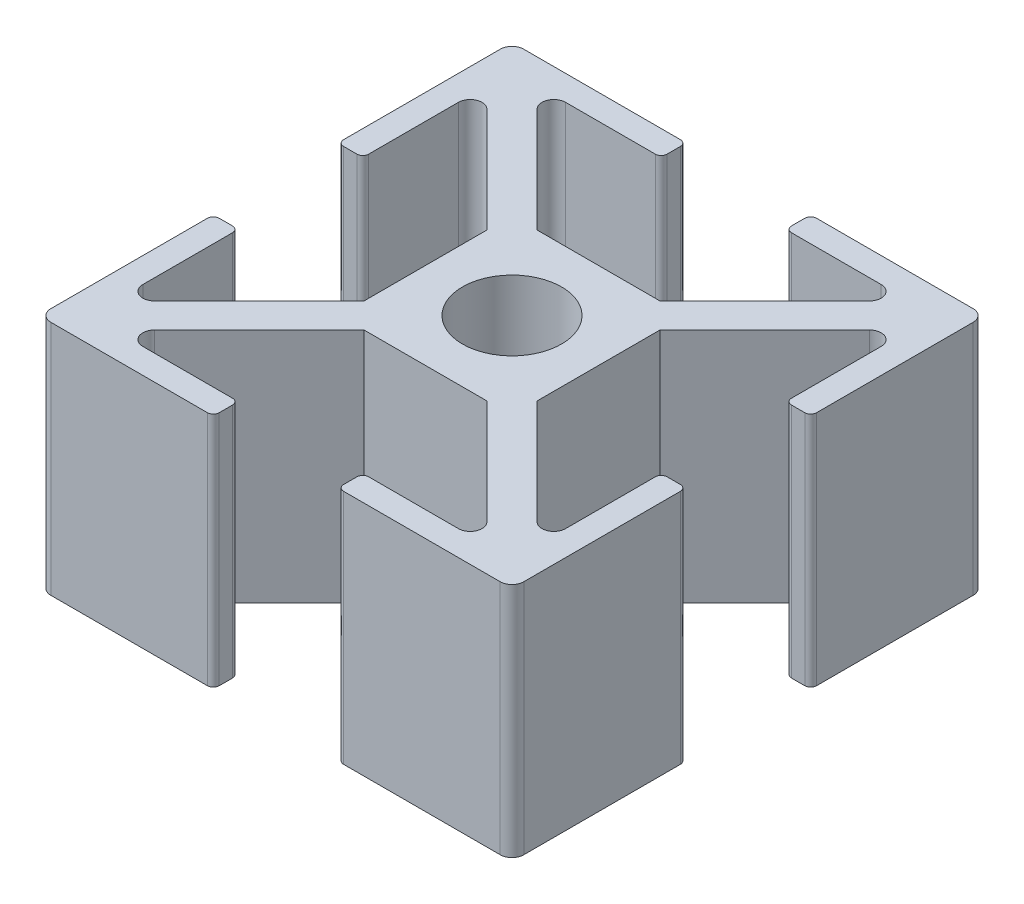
ISO-10303-21;
HEADER;
FILE_DESCRIPTION(('STEP AP214'),'2;1');
FILE_NAME('part.step','',(''),(''),'','','');
FILE_SCHEMA(('AUTOMOTIVE_DESIGN { 1 0 10303 214 1 1 1 1 }'));
ENDSEC;
DATA;
#1=APPLICATION_CONTEXT('core data for automotive mechanical design processes');
#2=APPLICATION_PROTOCOL_DEFINITION('international standard','automotive_design',2000,#1);
#3=PRODUCT_CONTEXT('',#1,'mechanical');
#4=PRODUCT('Part','Part','',(#3));
#5=PRODUCT_RELATED_PRODUCT_CATEGORY('part','',(#4));
#6=PRODUCT_DEFINITION_FORMATION('','',#4);
#7=PRODUCT_DEFINITION_CONTEXT('part definition',#1,'design');
#8=PRODUCT_DEFINITION('design','',#6,#7);
#9=PRODUCT_DEFINITION_SHAPE('','',#8);
#10=(LENGTH_UNIT() NAMED_UNIT(*) SI_UNIT(.MILLI.,.METRE.));
#11=(NAMED_UNIT(*) PLANE_ANGLE_UNIT() SI_UNIT($,.RADIAN.));
#12=(NAMED_UNIT(*) SI_UNIT($,.STERADIAN.) SOLID_ANGLE_UNIT());
#13=UNCERTAINTY_MEASURE_WITH_UNIT(LENGTH_MEASURE(1.E-05),#10,'distance_accuracy_value','');
#14=(GEOMETRIC_REPRESENTATION_CONTEXT(3) GLOBAL_UNCERTAINTY_ASSIGNED_CONTEXT((#13)) GLOBAL_UNIT_ASSIGNED_CONTEXT((#10,
#11,#12)) REPRESENTATION_CONTEXT('',''));
#15=CARTESIAN_POINT('',(0.,0.,0.));
#16=DIRECTION('',(0.,0.,1.));
#17=DIRECTION('',(1.,0.,0.));
#18=AXIS2_PLACEMENT_3D('',#15,#16,#17);
#19=CARTESIAN_POINT('',(0.,10.,-3.66));
#20=DIRECTION('',(0.,0.,-1.));
#21=DIRECTION('',(-1.,0.,0.));
#22=AXIS2_PLACEMENT_3D('',#19,#20,#21);
#23=PLANE('',#22);
#24=DIRECTION('',(1.,0.,0.));
#25=VECTOR('',#24,1.);
#26=CARTESIAN_POINT('',(0.,0.,-3.66));
#27=LINE('',#26,#25);
#28=CARTESIAN_POINT('',(-2.59933982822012,0.,-3.66));
#29=VERTEX_POINT('',#28);
#30=CARTESIAN_POINT('',(2.59933982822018,0.,-3.66));
#31=VERTEX_POINT('',#30);
#32=EDGE_CURVE('E747',#29,#31,#27,.T.);
#33=ORIENTED_EDGE('',*,*,#32,.F.);
#34=DIRECTION('',(0.,-1.,0.));
#35=VECTOR('',#34,1.);
#36=CARTESIAN_POINT('',(-2.59933982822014,10.,-3.66000000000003));
#37=LINE('',#36,#35);
#38=CARTESIAN_POINT('',(-2.59933982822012,10.,-3.66));
#39=VERTEX_POINT('',#38);
#40=EDGE_CURVE('E477',#39,#29,#37,.T.);
#41=ORIENTED_EDGE('',*,*,#40,.F.);
#42=DIRECTION('',(1.,0.,0.));
#43=VECTOR('',#42,1.);
#44=CARTESIAN_POINT('',(0.,10.,-3.66));
#45=LINE('',#44,#43);
#46=CARTESIAN_POINT('',(2.59933982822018,10.,-3.66));
#47=VERTEX_POINT('',#46);
#48=EDGE_CURVE('E464',#39,#47,#45,.T.);
#49=ORIENTED_EDGE('',*,*,#48,.T.);
#50=DIRECTION('',(0.,-1.,0.));
#51=VECTOR('',#50,1.);
#52=CARTESIAN_POINT('',(2.59933982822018,10.,-3.66));
#53=LINE('',#52,#51);
#54=EDGE_CURVE('E773',#47,#31,#53,.T.);
#55=ORIENTED_EDGE('',*,*,#54,.T.);
#56=EDGE_LOOP('',(#33,#41,#49,#55));
#57=FACE_BOUND('',#56,.T.);
#58=ADVANCED_FACE('F47',(#57),#23,.T.);
#59=CARTESIAN_POINT('',(-3.66,10.,0.));
#60=DIRECTION('',(-1.,0.,0.));
#61=DIRECTION('',(0.,0.,1.));
#62=AXIS2_PLACEMENT_3D('',#59,#60,#61);
#63=PLANE('',#62);
#64=DIRECTION('',(0.,0.,-1.));
#65=VECTOR('',#64,1.);
#66=CARTESIAN_POINT('',(-3.66,0.,0.));
#67=LINE('',#66,#65);
#68=CARTESIAN_POINT('',(-3.66000000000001,0.,2.59933982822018));
#69=VERTEX_POINT('',#68);
#70=CARTESIAN_POINT('',(-3.66,0.,-2.59933982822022));
#71=VERTEX_POINT('',#70);
#72=EDGE_CURVE('E750',#69,#71,#67,.T.);
#73=ORIENTED_EDGE('',*,*,#72,.F.);
#74=DIRECTION('',(0.,-1.,0.));
#75=VECTOR('',#74,1.);
#76=CARTESIAN_POINT('',(-3.66,10.,2.59933982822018));
#77=LINE('',#76,#75);
#78=CARTESIAN_POINT('',(-3.66000000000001,10.,2.59933982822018));
#79=VERTEX_POINT('',#78);
#80=EDGE_CURVE('E459',#79,#69,#77,.T.);
#81=ORIENTED_EDGE('',*,*,#80,.F.);
#82=DIRECTION('',(0.,0.,-1.));
#83=VECTOR('',#82,1.);
#84=CARTESIAN_POINT('',(-3.66,10.,0.));
#85=LINE('',#84,#83);
#86=CARTESIAN_POINT('',(-3.66,10.,-2.59933982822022));
#87=VERTEX_POINT('',#86);
#88=EDGE_CURVE('E452',#79,#87,#85,.T.);
#89=ORIENTED_EDGE('',*,*,#88,.T.);
#90=DIRECTION('',(0.,-1.,0.));
#91=VECTOR('',#90,1.);
#92=CARTESIAN_POINT('',(-3.65999999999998,10.,-2.59933982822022));
#93=LINE('',#92,#91);
#94=EDGE_CURVE('E456',#87,#71,#93,.T.);
#95=ORIENTED_EDGE('',*,*,#94,.T.);
#96=EDGE_LOOP('',(#73,#81,#89,#95));
#97=FACE_BOUND('',#96,.T.);
#98=ADVANCED_FACE('F455',(#97),#63,.T.);
#99=CARTESIAN_POINT('',(0.,10.,3.66));
#100=DIRECTION('',(0.,0.,-1.));
#101=DIRECTION('',(-1.,0.,0.));
#102=AXIS2_PLACEMENT_3D('',#99,#100,#101);
#103=PLANE('',#102);
#104=DIRECTION('',(0.,-1.,0.));
#105=VECTOR('',#104,1.);
#106=CARTESIAN_POINT('',(2.59933982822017,10.,3.66000000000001));
#107=LINE('',#106,#105);
#108=CARTESIAN_POINT('',(2.59933982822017,10.,3.66));
#109=VERTEX_POINT('',#108);
#110=CARTESIAN_POINT('',(2.59933982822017,0.,3.66));
#111=VERTEX_POINT('',#110);
#112=EDGE_CURVE('E639',#109,#111,#107,.T.);
#113=ORIENTED_EDGE('',*,*,#112,.F.);
#114=DIRECTION('',(1.,0.,0.));
#115=VECTOR('',#114,1.);
#116=CARTESIAN_POINT('',(0.,10.,3.66));
#117=LINE('',#116,#115);
#118=CARTESIAN_POINT('',(-2.59933982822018,10.,3.65999999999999));
#119=VERTEX_POINT('',#118);
#120=EDGE_CURVE('E463',#119,#109,#117,.T.);
#121=ORIENTED_EDGE('',*,*,#120,.F.);
#122=DIRECTION('',(0.,-1.,0.));
#123=VECTOR('',#122,1.);
#124=CARTESIAN_POINT('',(-2.59933982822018,10.,3.66));
#125=LINE('',#124,#123);
#126=CARTESIAN_POINT('',(-2.59933982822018,0.,3.66));
#127=VERTEX_POINT('',#126);
#128=EDGE_CURVE('E601',#119,#127,#125,.T.);
#129=ORIENTED_EDGE('',*,*,#128,.T.);
#130=DIRECTION('',(1.,0.,0.));
#131=VECTOR('',#130,1.);
#132=CARTESIAN_POINT('',(0.,0.,3.66));
#133=LINE('',#132,#131);
#134=EDGE_CURVE('E753',#127,#111,#133,.T.);
#135=ORIENTED_EDGE('',*,*,#134,.T.);
#136=EDGE_LOOP('',(#113,#121,#129,#135));
#137=FACE_BOUND('',#136,.T.);
#138=ADVANCED_FACE('F1200',(#137),#103,.F.);
#139=CARTESIAN_POINT('',(10.,10.,0.));
#140=DIRECTION('',(1.,0.,0.));
#141=DIRECTION('',(0.,0.,-1.));
#142=AXIS2_PLACEMENT_3D('',#139,#140,#141);
#143=PLANE('',#142);
#144=DIRECTION('',(0.,0.,1.));
#145=VECTOR('',#144,1.);
#146=CARTESIAN_POINT('',(10.,10.,0.));
#147=LINE('',#146,#145);
#148=CARTESIAN_POINT('',(10.,10.,-9.50000000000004));
#149=VERTEX_POINT('',#148);
#150=CARTESIAN_POINT('',(10.,10.,-2.88));
#151=VERTEX_POINT('',#150);
#152=EDGE_CURVE('E682',#149,#151,#147,.T.);
#153=ORIENTED_EDGE('',*,*,#152,.T.);
#154=DIRECTION('',(0.,-1.,0.));
#155=VECTOR('',#154,1.);
#156=CARTESIAN_POINT('',(10.,0.,-2.88));
#157=LINE('',#156,#155);
#158=CARTESIAN_POINT('',(10.,0.,-2.88));
#159=VERTEX_POINT('',#158);
#160=EDGE_CURVE('E864',#151,#159,#157,.T.);
#161=ORIENTED_EDGE('',*,*,#160,.T.);
#162=DIRECTION('',(0.,0.,1.));
#163=VECTOR('',#162,1.);
#164=CARTESIAN_POINT('',(10.,0.,0.));
#165=LINE('',#164,#163);
#166=CARTESIAN_POINT('',(10.,0.,-9.50000000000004));
#167=VERTEX_POINT('',#166);
#168=EDGE_CURVE('E727',#167,#159,#165,.T.);
#169=ORIENTED_EDGE('',*,*,#168,.F.);
#170=DIRECTION('',(0.,-1.,0.));
#171=VECTOR('',#170,1.);
#172=CARTESIAN_POINT('',(10.,10.,-9.50000000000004));
#173=LINE('',#172,#171);
#174=EDGE_CURVE('E798',#167,#149,#173,.F.);
#175=ORIENTED_EDGE('',*,*,#174,.T.);
#176=EDGE_LOOP('',(#153,#161,#169,#175));
#177=FACE_BOUND('',#176,.T.);
#178=ADVANCED_FACE('F1220',(#177),#143,.T.);
#179=CARTESIAN_POINT('',(0.,10.,-10.));
#180=DIRECTION('',(0.,0.,1.));
#181=DIRECTION('',(1.,0.,0.));
#182=AXIS2_PLACEMENT_3D('',#179,#180,#181);
#183=PLANE('',#182);
#184=DIRECTION('',(-1.,0.,0.));
#185=VECTOR('',#184,1.);
#186=CARTESIAN_POINT('',(0.,0.,-10.));
#187=LINE('',#186,#185);
#188=CARTESIAN_POINT('',(9.50000000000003,0.,-10.));
#189=VERTEX_POINT('',#188);
#190=CARTESIAN_POINT('',(2.88,0.,-10.));
#191=VERTEX_POINT('',#190);
#192=EDGE_CURVE('E731',#189,#191,#187,.T.);
#193=ORIENTED_EDGE('',*,*,#192,.T.);
#194=DIRECTION('',(0.,-1.,0.));
#195=VECTOR('',#194,1.);
#196=CARTESIAN_POINT('',(2.88,10.,-10.));
#197=LINE('',#196,#195);
#198=CARTESIAN_POINT('',(2.88,10.,-10.));
#199=VERTEX_POINT('',#198);
#200=EDGE_CURVE('E835',#191,#199,#197,.F.);
#201=ORIENTED_EDGE('',*,*,#200,.T.);
#202=DIRECTION('',(-1.,0.,0.));
#203=VECTOR('',#202,1.);
#204=CARTESIAN_POINT('',(0.,10.,-10.));
#205=LINE('',#204,#203);
#206=CARTESIAN_POINT('',(9.50000000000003,10.,-10.));
#207=VERTEX_POINT('',#206);
#208=EDGE_CURVE('E687',#207,#199,#205,.T.);
#209=ORIENTED_EDGE('',*,*,#208,.F.);
#210=DIRECTION('',(0.,-1.,0.));
#211=VECTOR('',#210,1.);
#212=CARTESIAN_POINT('',(9.50000000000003,0.,-10.));
#213=LINE('',#212,#211);
#214=EDGE_CURVE('E791',#207,#189,#213,.T.);
#215=ORIENTED_EDGE('',*,*,#214,.T.);
#216=EDGE_LOOP('',(#193,#201,#209,#215));
#217=FACE_BOUND('',#216,.T.);
#218=ADVANCED_FACE('F1216',(#217),#183,.F.);
#219=CARTESIAN_POINT('',(2.63,10.,0.));
#220=DIRECTION('',(-1.,0.,0.));
#221=DIRECTION('',(0.,0.,1.));
#222=AXIS2_PLACEMENT_3D('',#219,#220,#221);
#223=PLANE('',#222);
#224=DIRECTION('',(0.,0.,-1.));
#225=VECTOR('',#224,1.);
#226=CARTESIAN_POINT('',(2.63,10.,0.));
#227=LINE('',#226,#225);
#228=CARTESIAN_POINT('',(2.63,10.,-9.18933982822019));
#229=VERTEX_POINT('',#228);
#230=CARTESIAN_POINT('',(2.63,10.,-9.75000000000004));
#231=VERTEX_POINT('',#230);
#232=EDGE_CURVE('E691',#229,#231,#227,.T.);
#233=ORIENTED_EDGE('',*,*,#232,.T.);
#234=DIRECTION('',(0.,-1.,0.));
#235=VECTOR('',#234,1.);
#236=CARTESIAN_POINT('',(2.63,0.,-9.75000000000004));
#237=LINE('',#236,#235);
#238=CARTESIAN_POINT('',(2.63,0.,-9.75000000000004));
#239=VERTEX_POINT('',#238);
#240=EDGE_CURVE('E819',#231,#239,#237,.T.);
#241=ORIENTED_EDGE('',*,*,#240,.T.);
#242=DIRECTION('',(0.,0.,-1.));
#243=VECTOR('',#242,1.);
#244=CARTESIAN_POINT('',(2.63,0.,0.));
#245=LINE('',#244,#243);
#246=CARTESIAN_POINT('',(2.63,0.,-9.18933982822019));
#247=VERTEX_POINT('',#246);
#248=EDGE_CURVE('E735',#247,#239,#245,.T.);
#249=ORIENTED_EDGE('',*,*,#248,.F.);
#250=DIRECTION('',(0.,-1.,0.));
#251=VECTOR('',#250,1.);
#252=CARTESIAN_POINT('',(2.63,10.,-9.18933982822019));
#253=LINE('',#252,#251);
#254=EDGE_CURVE('E816',#247,#229,#253,.F.);
#255=ORIENTED_EDGE('',*,*,#254,.T.);
#256=EDGE_LOOP('',(#233,#241,#249,#255));
#257=FACE_BOUND('',#256,.T.);
#258=ADVANCED_FACE('F1212',(#257),#223,.T.);
#259=CARTESIAN_POINT('',(0.,10.,-8.93933982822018));
#260=DIRECTION('',(0.,0.,1.));
#261=DIRECTION('',(1.,0.,0.));
#262=AXIS2_PLACEMENT_3D('',#259,#260,#261);
#263=PLANE('',#262);
#264=DIRECTION('',(-1.,0.,0.));
#265=VECTOR('',#264,1.);
#266=CARTESIAN_POINT('',(0.,10.,-8.93933982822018));
#267=LINE('',#266,#265);
#268=CARTESIAN_POINT('',(6.67157287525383,10.,-8.93933982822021));
#269=VERTEX_POINT('',#268);
#270=CARTESIAN_POINT('',(2.88,10.,-8.93933982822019));
#271=VERTEX_POINT('',#270);
#272=EDGE_CURVE('E695',#269,#271,#267,.T.);
#273=ORIENTED_EDGE('',*,*,#272,.T.);
#274=DIRECTION('',(0.,-1.,0.));
#275=VECTOR('',#274,1.);
#276=CARTESIAN_POINT('',(2.88,10.,-8.93933982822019));
#277=LINE('',#276,#275);
#278=CARTESIAN_POINT('',(2.88,0.,-8.93933982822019));
#279=VERTEX_POINT('',#278);
#280=EDGE_CURVE('E850',#271,#279,#277,.T.);
#281=ORIENTED_EDGE('',*,*,#280,.T.);
#282=DIRECTION('',(-1.,0.,0.));
#283=VECTOR('',#282,1.);
#284=CARTESIAN_POINT('',(0.,0.,-8.93933982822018));
#285=LINE('',#284,#283);
#286=CARTESIAN_POINT('',(6.67157287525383,0.,-8.93933982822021));
#287=VERTEX_POINT('',#286);
#288=EDGE_CURVE('E739',#287,#279,#285,.T.);
#289=ORIENTED_EDGE('',*,*,#288,.F.);
#290=DIRECTION('',(0.,-1.,0.));
#291=VECTOR('',#290,1.);
#292=CARTESIAN_POINT('',(6.67157287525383,10.,-8.93933982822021));
#293=LINE('',#292,#291);
#294=EDGE_CURVE('E781',#287,#269,#293,.F.);
#295=ORIENTED_EDGE('',*,*,#294,.T.);
#296=EDGE_LOOP('',(#273,#281,#289,#295));
#297=FACE_BOUND('',#296,.T.);
#298=ADVANCED_FACE('F1208',(#297),#263,.T.);
#299=CARTESIAN_POINT('',(-0.530330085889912,10.,-0.530330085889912));
#300=DIRECTION('',(-0.707106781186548,0.,-0.707106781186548));
#301=DIRECTION('',(-0.707106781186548,0.,0.707106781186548));
#302=AXIS2_PLACEMENT_3D('',#299,#300,#301);
#303=PLANE('',#302);
#304=DIRECTION('',(0.707106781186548,0.,-0.707106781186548));
#305=VECTOR('',#304,1.);
#306=CARTESIAN_POINT('',(-0.530330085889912,10.,-0.530330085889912));
#307=LINE('',#306,#305);
#308=CARTESIAN_POINT('',(7.02512626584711,10.,-8.08578643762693));
#309=VERTEX_POINT('',#308);
#310=EDGE_CURVE('E699',#47,#309,#307,.T.);
#311=ORIENTED_EDGE('',*,*,#310,.T.);
#312=DIRECTION('',(0.,-1.,0.));
#313=VECTOR('',#312,1.);
#314=CARTESIAN_POINT('',(7.02512626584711,0.,-8.08578643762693));
#315=LINE('',#314,#313);
#316=CARTESIAN_POINT('',(7.02512626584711,0.,-8.08578643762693));
#317=VERTEX_POINT('',#316);
#318=EDGE_CURVE('E777',#309,#317,#315,.T.);
#319=ORIENTED_EDGE('',*,*,#318,.T.);
#320=DIRECTION('',(0.707106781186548,0.,-0.707106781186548));
#321=VECTOR('',#320,1.);
#322=CARTESIAN_POINT('',(-0.530330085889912,0.,-0.530330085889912));
#323=LINE('',#322,#321);
#324=EDGE_CURVE('E743',#31,#317,#323,.T.);
#325=ORIENTED_EDGE('',*,*,#324,.F.);
#326=ORIENTED_EDGE('',*,*,#54,.F.);
#327=EDGE_LOOP('',(#311,#319,#325,#326));
#328=FACE_BOUND('',#327,.T.);
#329=ADVANCED_FACE('F1204',(#328),#303,.T.);
#330=CARTESIAN_POINT('',(3.66,10.,0.));
#331=DIRECTION('',(-1.,0.,0.));
#332=DIRECTION('',(0.,0.,1.));
#333=AXIS2_PLACEMENT_3D('',#330,#331,#332);
#334=PLANE('',#333);
#335=DIRECTION('',(0.,0.,-1.));
#336=VECTOR('',#335,1.);
#337=CARTESIAN_POINT('',(3.66,10.,0.));
#338=LINE('',#337,#336);
#339=CARTESIAN_POINT('',(3.66,10.,2.59933982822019));
#340=VERTEX_POINT('',#339);
#341=CARTESIAN_POINT('',(3.66,10.,-2.59933982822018));
#342=VERTEX_POINT('',#341);
#343=EDGE_CURVE('E708',#340,#342,#338,.T.);
#344=ORIENTED_EDGE('',*,*,#343,.F.);
#345=DIRECTION('',(0.,-1.,0.));
#346=VECTOR('',#345,1.);
#347=CARTESIAN_POINT('',(3.65999999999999,10.,2.59933982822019));
#348=LINE('',#347,#346);
#349=CARTESIAN_POINT('',(3.65999999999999,0.,2.59933982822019));
#350=VERTEX_POINT('',#349);
#351=EDGE_CURVE('E673',#340,#350,#348,.T.);
#352=ORIENTED_EDGE('',*,*,#351,.T.);
#353=DIRECTION('',(0.,0.,-1.));
#354=VECTOR('',#353,1.);
#355=CARTESIAN_POINT('',(3.66,0.,0.));
#356=LINE('',#355,#354);
#357=CARTESIAN_POINT('',(3.66,0.,-2.59933982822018));
#358=VERTEX_POINT('',#357);
#359=EDGE_CURVE('E756',#350,#358,#356,.T.);
#360=ORIENTED_EDGE('',*,*,#359,.T.);
#361=DIRECTION('',(0.,-1.,0.));
#362=VECTOR('',#361,1.);
#363=CARTESIAN_POINT('',(3.66,10.,-2.59933982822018));
#364=LINE('',#363,#362);
#365=EDGE_CURVE('E723',#342,#358,#364,.T.);
#366=ORIENTED_EDGE('',*,*,#365,.F.);
#367=EDGE_LOOP('',(#344,#352,#360,#366));
#368=FACE_BOUND('',#367,.T.);
#369=ADVANCED_FACE('F1207',(#368),#334,.F.);
#370=CARTESIAN_POINT('',(0.53033008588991,10.,0.53033008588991));
#371=DIRECTION('',(-0.707106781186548,0.,-0.707106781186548));
#372=DIRECTION('',(-0.707106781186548,0.,0.707106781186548));
#373=AXIS2_PLACEMENT_3D('',#370,#371,#372);
#374=PLANE('',#373);
#375=DIRECTION('',(0.707106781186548,0.,-0.707106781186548));
#376=VECTOR('',#375,1.);
#377=CARTESIAN_POINT('',(0.53033008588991,0.,0.53033008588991));
#378=LINE('',#377,#376);
#379=CARTESIAN_POINT('',(8.08578643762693,0.,-7.02512626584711));
#380=VERTEX_POINT('',#379);
#381=EDGE_CURVE('E759',#358,#380,#378,.T.);
#382=ORIENTED_EDGE('',*,*,#381,.T.);
#383=DIRECTION('',(0.,-1.,0.));
#384=VECTOR('',#383,1.);
#385=CARTESIAN_POINT('',(8.08578643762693,10.,-7.02512626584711));
#386=LINE('',#385,#384);
#387=CARTESIAN_POINT('',(8.08578643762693,10.,-7.02512626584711));
#388=VERTEX_POINT('',#387);
#389=EDGE_CURVE('E788',#380,#388,#386,.F.);
#390=ORIENTED_EDGE('',*,*,#389,.T.);
#391=DIRECTION('',(0.707106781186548,0.,-0.707106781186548));
#392=VECTOR('',#391,1.);
#393=CARTESIAN_POINT('',(0.53033008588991,10.,0.53033008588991));
#394=LINE('',#393,#392);
#395=EDGE_CURVE('E711',#342,#388,#394,.T.);
#396=ORIENTED_EDGE('',*,*,#395,.F.);
#397=ORIENTED_EDGE('',*,*,#365,.T.);
#398=EDGE_LOOP('',(#382,#390,#396,#397));
#399=FACE_BOUND('',#398,.T.);
#400=ADVANCED_FACE('F1414',(#399),#374,.F.);
#401=CARTESIAN_POINT('',(8.93933982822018,10.,0.));
#402=DIRECTION('',(1.,0.,0.));
#403=DIRECTION('',(0.,0.,-1.));
#404=AXIS2_PLACEMENT_3D('',#401,#402,#403);
#405=PLANE('',#404);
#406=DIRECTION('',(0.,0.,1.));
#407=VECTOR('',#406,1.);
#408=CARTESIAN_POINT('',(8.93933982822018,0.,0.));
#409=LINE('',#408,#407);
#410=CARTESIAN_POINT('',(8.9393398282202,0.,-6.67157287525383));
#411=VERTEX_POINT('',#410);
#412=CARTESIAN_POINT('',(8.93933982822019,0.,-2.88000000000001));
#413=VERTEX_POINT('',#412);
#414=EDGE_CURVE('E763',#411,#413,#409,.T.);
#415=ORIENTED_EDGE('',*,*,#414,.T.);
#416=DIRECTION('',(0.,-1.,0.));
#417=VECTOR('',#416,1.);
#418=CARTESIAN_POINT('',(8.93933982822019,10.,-2.88000000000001));
#419=LINE('',#418,#417);
#420=CARTESIAN_POINT('',(8.93933982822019,10.,-2.88000000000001));
#421=VERTEX_POINT('',#420);
#422=EDGE_CURVE('E861',#413,#421,#419,.F.);
#423=ORIENTED_EDGE('',*,*,#422,.T.);
#424=DIRECTION('',(0.,0.,1.));
#425=VECTOR('',#424,1.);
#426=CARTESIAN_POINT('',(8.93933982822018,10.,0.));
#427=LINE('',#426,#425);
#428=CARTESIAN_POINT('',(8.9393398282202,10.,-6.67157287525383));
#429=VERTEX_POINT('',#428);
#430=EDGE_CURVE('E715',#429,#421,#427,.T.);
#431=ORIENTED_EDGE('',*,*,#430,.F.);
#432=DIRECTION('',(0.,-1.,0.));
#433=VECTOR('',#432,1.);
#434=CARTESIAN_POINT('',(8.9393398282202,0.,-6.67157287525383));
#435=LINE('',#434,#433);
#436=EDGE_CURVE('E784',#429,#411,#435,.T.);
#437=ORIENTED_EDGE('',*,*,#436,.T.);
#438=EDGE_LOOP('',(#415,#423,#431,#437));
#439=FACE_BOUND('',#438,.T.);
#440=ADVANCED_FACE('F1229',(#439),#405,.F.);
#441=CARTESIAN_POINT('',(0.,10.,0.));
#442=DIRECTION('',(0.,-1.,0.));
#443=DIRECTION('',(0.,0.,-1.));
#444=AXIS2_PLACEMENT_3D('',#441,#442,#443);
#445=CYLINDRICAL_SURFACE('',#444,2.095);
#446=CARTESIAN_POINT('',(0.,10.,0.));
#447=DIRECTION('',(0.,1.,0.));
#448=DIRECTION('',(0.,0.,1.));
#449=AXIS2_PLACEMENT_3D('',#446,#447,#448);
#450=CIRCLE('',#449,2.095);
#451=CARTESIAN_POINT('',(0.,10.,2.095));
#452=VERTEX_POINT('',#451);
#453=EDGE_CURVE('E678',#452,#452,#450,.T.);
#454=ORIENTED_EDGE('',*,*,#453,.T.);
#455=EDGE_LOOP('',(#454));
#456=FACE_BOUND('',#455,.T.);
#457=CARTESIAN_POINT('',(0.,0.,0.));
#458=DIRECTION('',(0.,1.,0.));
#459=DIRECTION('',(0.,0.,1.));
#460=AXIS2_PLACEMENT_3D('',#457,#458,#459);
#461=CIRCLE('',#460,2.095);
#462=CARTESIAN_POINT('',(0.,0.,2.095));
#463=VERTEX_POINT('',#462);
#464=EDGE_CURVE('E677',#463,#463,#461,.T.);
#465=ORIENTED_EDGE('',*,*,#464,.F.);
#466=EDGE_LOOP('',(#465));
#467=FACE_BOUND('',#466,.T.);
#468=ADVANCED_FACE('F1225',(#456,#467),#445,.F.);
#469=CARTESIAN_POINT('',(0.,10.,-2.63000000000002));
#470=DIRECTION('',(0.,0.,-1.));
#471=DIRECTION('',(-1.,0.,0.));
#472=AXIS2_PLACEMENT_3D('',#469,#470,#471);
#473=PLANE('',#472);
#474=DIRECTION('',(1.,0.,0.));
#475=VECTOR('',#474,1.);
#476=CARTESIAN_POINT('',(0.,10.,-2.63000000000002));
#477=LINE('',#476,#475);
#478=CARTESIAN_POINT('',(9.18933982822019,10.,-2.63000000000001));
#479=VERTEX_POINT('',#478);
#480=CARTESIAN_POINT('',(9.75000000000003,10.,-2.63));
#481=VERTEX_POINT('',#480);
#482=EDGE_CURVE('E719',#479,#481,#477,.T.);
#483=ORIENTED_EDGE('',*,*,#482,.F.);
#484=DIRECTION('',(0.,-1.,0.));
#485=VECTOR('',#484,1.);
#486=CARTESIAN_POINT('',(9.18933982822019,10.,-2.63000000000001));
#487=LINE('',#486,#485);
#488=CARTESIAN_POINT('',(9.18933982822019,0.,-2.63000000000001));
#489=VERTEX_POINT('',#488);
#490=EDGE_CURVE('E857',#479,#489,#487,.T.);
#491=ORIENTED_EDGE('',*,*,#490,.T.);
#492=DIRECTION('',(1.,0.,0.));
#493=VECTOR('',#492,1.);
#494=CARTESIAN_POINT('',(0.,0.,-2.63000000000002));
#495=LINE('',#494,#493);
#496=CARTESIAN_POINT('',(9.75000000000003,0.,-2.63));
#497=VERTEX_POINT('',#496);
#498=EDGE_CURVE('E683',#489,#497,#495,.T.);
#499=ORIENTED_EDGE('',*,*,#498,.T.);
#500=DIRECTION('',(0.,-1.,0.));
#501=VECTOR('',#500,1.);
#502=CARTESIAN_POINT('',(9.75000000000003,10.,-2.63));
#503=LINE('',#502,#501);
#504=EDGE_CURVE('E854',#497,#481,#503,.F.);
#505=ORIENTED_EDGE('',*,*,#504,.T.);
#506=EDGE_LOOP('',(#483,#491,#499,#505));
#507=FACE_BOUND('',#506,.T.);
#508=ADVANCED_FACE('F1228',(#507),#473,.F.);
#509=CARTESIAN_POINT('',(0.,10.,0.));
#510=DIRECTION('',(0.,1.,0.));
#511=DIRECTION('',(0.,0.,1.));
#512=AXIS2_PLACEMENT_3D('',#509,#510,#511);
#513=PLANE('',#512);
#514=DIRECTION('',(0.,0.,1.));
#515=VECTOR('',#514,1.);
#516=CARTESIAN_POINT('',(-10.,10.,-1.04744440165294E-13));
#517=LINE('',#516,#515);
#518=CARTESIAN_POINT('',(-9.99999999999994,10.,-9.50000000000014));
#519=VERTEX_POINT('',#518);
#520=CARTESIAN_POINT('',(-10.,10.,-2.88000000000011));
#521=VERTEX_POINT('',#520);
#522=EDGE_CURVE('E1157',#519,#521,#517,.T.);
#523=ORIENTED_EDGE('',*,*,#522,.T.);
#524=CARTESIAN_POINT('',(-9.75000000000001,10.,-2.8800000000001));
#525=DIRECTION('',(0.,1.,0.));
#526=DIRECTION('',(0.,0.,1.));
#527=AXIS2_PLACEMENT_3D('',#524,#525,#526);
#528=CIRCLE('',#527,0.25);
#529=CARTESIAN_POINT('',(-9.75000000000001,10.,-2.6300000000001));
#530=VERTEX_POINT('',#529);
#531=EDGE_CURVE('E1116',#521,#530,#528,.T.);
#532=ORIENTED_EDGE('',*,*,#531,.T.);
#533=DIRECTION('',(-1.,0.,0.));
#534=VECTOR('',#533,1.);
#535=CARTESIAN_POINT('',(0.,10.,-2.63));
#536=LINE('',#535,#534);
#537=CARTESIAN_POINT('',(-9.18933982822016,10.,-2.6300000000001));
#538=VERTEX_POINT('',#537);
#539=EDGE_CURVE('E493',#538,#530,#536,.T.);
#540=ORIENTED_EDGE('',*,*,#539,.F.);
#541=CARTESIAN_POINT('',(-9.18933982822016,10.,-2.8800000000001));
#542=DIRECTION('',(0.,1.,0.));
#543=DIRECTION('',(0.,0.,1.));
#544=AXIS2_PLACEMENT_3D('',#541,#542,#543);
#545=CIRCLE('',#544,0.25);
#546=CARTESIAN_POINT('',(-8.93933982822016,10.,-2.8800000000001));
#547=VERTEX_POINT('',#546);
#548=EDGE_CURVE('E63',#538,#547,#545,.T.);
#549=ORIENTED_EDGE('',*,*,#548,.T.);
#550=DIRECTION('',(0.,0.,1.));
#551=VECTOR('',#550,1.);
#552=CARTESIAN_POINT('',(-8.93933982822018,10.,0.));
#553=LINE('',#552,#551);
#554=CARTESIAN_POINT('',(-8.93933982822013,10.,-6.67157287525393));
#555=VERTEX_POINT('',#554);
#556=EDGE_CURVE('E486',#555,#547,#553,.T.);
#557=ORIENTED_EDGE('',*,*,#556,.F.);
#558=CARTESIAN_POINT('',(-8.43933982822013,10.,-6.67157287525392));
#559=DIRECTION('',(0.,1.,0.));
#560=DIRECTION('',(0.,0.,1.));
#561=AXIS2_PLACEMENT_3D('',#558,#559,#560);
#562=CIRCLE('',#561,0.5);
#563=CARTESIAN_POINT('',(-8.08578643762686,10.,-7.02512626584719));
#564=VERTEX_POINT('',#563);
#565=EDGE_CURVE('E483',#555,#564,#562,.F.);
#566=ORIENTED_EDGE('',*,*,#565,.T.);
#567=DIRECTION('',(-0.70710678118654,0.,-0.707106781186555));
#568=VECTOR('',#567,1.);
#569=CARTESIAN_POINT('',(-0.530330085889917,10.,0.530330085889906));
#570=LINE('',#569,#568);
#571=EDGE_CURVE('E471',#87,#564,#570,.T.);
#572=ORIENTED_EDGE('',*,*,#571,.F.);
#573=ORIENTED_EDGE('',*,*,#88,.F.);
#574=DIRECTION('',(-0.707106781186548,0.,0.707106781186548));
#575=VECTOR('',#574,1.);
#576=CARTESIAN_POINT('',(-0.53033008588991,10.,-0.53033008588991));
#577=LINE('',#576,#575);
#578=CARTESIAN_POINT('',(-8.08578643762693,10.,7.02512626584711));
#579=VERTEX_POINT('',#578);
#580=EDGE_CURVE('E558',#79,#579,#577,.T.);
#581=ORIENTED_EDGE('',*,*,#580,.T.);
#582=CARTESIAN_POINT('',(-8.4393398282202,10.,6.67157287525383));
#583=DIRECTION('',(0.,1.,0.));
#584=DIRECTION('',(0.,0.,1.));
#585=AXIS2_PLACEMENT_3D('',#582,#583,#584);
#586=CIRCLE('',#585,0.5);
#587=CARTESIAN_POINT('',(-8.9393398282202,10.,6.67157287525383));
#588=VERTEX_POINT('',#587);
#589=EDGE_CURVE('E943',#579,#588,#586,.F.);
#590=ORIENTED_EDGE('',*,*,#589,.T.);
#591=DIRECTION('',(0.,0.,-1.));
#592=VECTOR('',#591,1.);
#593=CARTESIAN_POINT('',(-8.93933982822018,10.,0.));
#594=LINE('',#593,#592);
#595=CARTESIAN_POINT('',(-8.93933982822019,10.,2.88000000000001));
#596=VERTEX_POINT('',#595);
#597=EDGE_CURVE('E561',#588,#596,#594,.T.);
#598=ORIENTED_EDGE('',*,*,#597,.T.);
#599=CARTESIAN_POINT('',(-9.18933982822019,10.,2.88000000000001));
#600=DIRECTION('',(0.,1.,0.));
#601=DIRECTION('',(0.,0.,1.));
#602=AXIS2_PLACEMENT_3D('',#599,#600,#601);
#603=CIRCLE('',#602,0.25);
#604=CARTESIAN_POINT('',(-9.18933982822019,10.,2.63000000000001));
#605=VERTEX_POINT('',#604);
#606=EDGE_CURVE('E1060',#596,#605,#603,.T.);
#607=ORIENTED_EDGE('',*,*,#606,.T.);
#608=DIRECTION('',(-1.,0.,0.));
#609=VECTOR('',#608,1.);
#610=CARTESIAN_POINT('',(0.,10.,2.63000000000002));
#611=LINE('',#610,#609);
#612=CARTESIAN_POINT('',(-9.75000000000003,10.,2.63));
#613=VERTEX_POINT('',#612);
#614=EDGE_CURVE('E565',#605,#613,#611,.T.);
#615=ORIENTED_EDGE('',*,*,#614,.T.);
#616=CARTESIAN_POINT('',(-9.75000000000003,10.,2.88));
#617=DIRECTION('',(0.,1.,0.));
#618=DIRECTION('',(0.,0.,1.));
#619=AXIS2_PLACEMENT_3D('',#616,#617,#618);
#620=CIRCLE('',#619,0.25);
#621=CARTESIAN_POINT('',(-10.,10.,2.88));
#622=VERTEX_POINT('',#621);
#623=EDGE_CURVE('E1057',#613,#622,#620,.T.);
#624=ORIENTED_EDGE('',*,*,#623,.T.);
#625=DIRECTION('',(0.,0.,-1.));
#626=VECTOR('',#625,1.);
#627=CARTESIAN_POINT('',(-10.,10.,0.));
#628=LINE('',#627,#626);
#629=CARTESIAN_POINT('',(-10.,10.,9.50000000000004));
#630=VERTEX_POINT('',#629);
#631=EDGE_CURVE('E537',#630,#622,#628,.T.);
#632=ORIENTED_EDGE('',*,*,#631,.F.);
#633=CARTESIAN_POINT('',(-9.50000000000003,10.,9.50000000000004));
#634=DIRECTION('',(0.,1.,0.));
#635=DIRECTION('',(0.,0.,1.));
#636=AXIS2_PLACEMENT_3D('',#633,#634,#635);
#637=CIRCLE('',#636,0.5);
#638=CARTESIAN_POINT('',(-9.50000000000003,10.,10.));
#639=VERTEX_POINT('',#638);
#640=EDGE_CURVE('E931',#630,#639,#637,.T.);
#641=ORIENTED_EDGE('',*,*,#640,.T.);
#642=DIRECTION('',(1.,0.,0.));
#643=VECTOR('',#642,1.);
#644=CARTESIAN_POINT('',(0.,10.,10.));
#645=LINE('',#644,#643);
#646=CARTESIAN_POINT('',(-2.88,10.,10.));
#647=VERTEX_POINT('',#646);
#648=EDGE_CURVE('E541',#639,#647,#645,.T.);
#649=ORIENTED_EDGE('',*,*,#648,.T.);
#650=CARTESIAN_POINT('',(-2.88,10.,9.75000000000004));
#651=DIRECTION('',(0.,1.,0.));
#652=DIRECTION('',(0.,0.,1.));
#653=AXIS2_PLACEMENT_3D('',#650,#651,#652);
#654=CIRCLE('',#653,0.25);
#655=CARTESIAN_POINT('',(-2.63,10.,9.75000000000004));
#656=VERTEX_POINT('',#655);
#657=EDGE_CURVE('E1066',#647,#656,#654,.T.);
#658=ORIENTED_EDGE('',*,*,#657,.T.);
#659=DIRECTION('',(0.,0.,1.));
#660=VECTOR('',#659,1.);
#661=CARTESIAN_POINT('',(-2.63,10.,0.));
#662=LINE('',#661,#660);
#663=CARTESIAN_POINT('',(-2.63,10.,9.18933982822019));
#664=VERTEX_POINT('',#663);
#665=EDGE_CURVE('E546',#664,#656,#662,.T.);
#666=ORIENTED_EDGE('',*,*,#665,.F.);
#667=CARTESIAN_POINT('',(-2.88,10.,9.18933982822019));
#668=DIRECTION('',(0.,1.,0.));
#669=DIRECTION('',(0.,0.,1.));
#670=AXIS2_PLACEMENT_3D('',#667,#668,#669);
#671=CIRCLE('',#670,0.25);
#672=CARTESIAN_POINT('',(-2.88,10.,8.93933982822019));
#673=VERTEX_POINT('',#672);
#674=EDGE_CURVE('E1063',#664,#673,#671,.T.);
#675=ORIENTED_EDGE('',*,*,#674,.T.);
#676=DIRECTION('',(1.,0.,0.));
#677=VECTOR('',#676,1.);
#678=CARTESIAN_POINT('',(0.,10.,8.93933982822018));
#679=LINE('',#678,#677);
#680=CARTESIAN_POINT('',(-6.67157287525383,10.,8.93933982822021));
#681=VERTEX_POINT('',#680);
#682=EDGE_CURVE('E550',#681,#673,#679,.T.);
#683=ORIENTED_EDGE('',*,*,#682,.F.);
#684=CARTESIAN_POINT('',(-6.67157287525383,10.,8.4393398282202));
#685=DIRECTION('',(0.,1.,0.));
#686=DIRECTION('',(0.,0.,1.));
#687=AXIS2_PLACEMENT_3D('',#684,#685,#686);
#688=CIRCLE('',#687,0.5);
#689=CARTESIAN_POINT('',(-7.02512626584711,10.,8.08578643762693));
#690=VERTEX_POINT('',#689);
#691=EDGE_CURVE('E937',#681,#690,#688,.F.);
#692=ORIENTED_EDGE('',*,*,#691,.T.);
#693=DIRECTION('',(-0.707106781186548,0.,0.707106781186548));
#694=VECTOR('',#693,1.);
#695=CARTESIAN_POINT('',(0.530330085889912,10.,0.530330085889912));
#696=LINE('',#695,#694);
#697=EDGE_CURVE('E554',#119,#690,#696,.T.);
#698=ORIENTED_EDGE('',*,*,#697,.F.);
#699=ORIENTED_EDGE('',*,*,#120,.T.);
#700=DIRECTION('',(0.707106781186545,0.,0.70710678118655));
#701=VECTOR('',#700,1.);
#702=CARTESIAN_POINT('',(-0.530330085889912,10.,0.530330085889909));
#703=LINE('',#702,#701);
#704=CARTESIAN_POINT('',(7.02512626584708,10.,8.08578643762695));
#705=VERTEX_POINT('',#704);
#706=EDGE_CURVE('E627',#109,#705,#703,.T.);
#707=ORIENTED_EDGE('',*,*,#706,.T.);
#708=CARTESIAN_POINT('',(6.67157287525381,10.,8.43933982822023));
#709=DIRECTION('',(0.,1.,0.));
#710=DIRECTION('',(0.,0.,1.));
#711=AXIS2_PLACEMENT_3D('',#708,#709,#710);
#712=CIRCLE('',#711,0.5);
#713=CARTESIAN_POINT('',(6.6715728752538,10.,8.93933982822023));
#714=VERTEX_POINT('',#713);
#715=EDGE_CURVE('E904',#705,#714,#712,.F.);
#716=ORIENTED_EDGE('',*,*,#715,.T.);
#717=DIRECTION('',(-1.,0.,0.));
#718=VECTOR('',#717,1.);
#719=CARTESIAN_POINT('',(0.,10.,8.93933982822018));
#720=LINE('',#719,#718);
#721=CARTESIAN_POINT('',(2.87999999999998,10.,8.9393398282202));
#722=VERTEX_POINT('',#721);
#723=EDGE_CURVE('E631',#714,#722,#720,.T.);
#724=ORIENTED_EDGE('',*,*,#723,.T.);
#725=CARTESIAN_POINT('',(2.87999999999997,10.,9.1893398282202));
#726=DIRECTION('',(0.,1.,0.));
#727=DIRECTION('',(0.,0.,1.));
#728=AXIS2_PLACEMENT_3D('',#725,#726,#727);
#729=CIRCLE('',#728,0.25);
#730=CARTESIAN_POINT('',(2.62999999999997,10.,9.1893398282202));
#731=VERTEX_POINT('',#730);
#732=EDGE_CURVE('E1008',#722,#731,#729,.T.);
#733=ORIENTED_EDGE('',*,*,#732,.T.);
#734=DIRECTION('',(0.,0.,1.));
#735=VECTOR('',#734,1.);
#736=CARTESIAN_POINT('',(2.63000000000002,10.,0.));
#737=LINE('',#736,#735);
#738=CARTESIAN_POINT('',(2.62999999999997,10.,9.75000000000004));
#739=VERTEX_POINT('',#738);
#740=EDGE_CURVE('E635',#731,#739,#737,.T.);
#741=ORIENTED_EDGE('',*,*,#740,.T.);
#742=CARTESIAN_POINT('',(2.87999999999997,10.,9.75000000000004));
#743=DIRECTION('',(0.,1.,0.));
#744=DIRECTION('',(0.,0.,1.));
#745=AXIS2_PLACEMENT_3D('',#742,#743,#744);
#746=CIRCLE('',#745,0.25);
#747=CARTESIAN_POINT('',(2.87999999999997,10.,10.));
#748=VERTEX_POINT('',#747);
#749=EDGE_CURVE('E1005',#739,#748,#746,.T.);
#750=ORIENTED_EDGE('',*,*,#749,.T.);
#751=DIRECTION('',(-1.,0.,0.));
#752=VECTOR('',#751,1.);
#753=CARTESIAN_POINT('',(0.,10.,10.));
#754=LINE('',#753,#752);
#755=CARTESIAN_POINT('',(9.5,10.,10.0000000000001));
#756=VERTEX_POINT('',#755);
#757=EDGE_CURVE('E606',#756,#748,#754,.T.);
#758=ORIENTED_EDGE('',*,*,#757,.F.);
#759=CARTESIAN_POINT('',(9.5,10.,9.50000000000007));
#760=DIRECTION('',(0.,1.,0.));
#761=DIRECTION('',(0.,0.,1.));
#762=AXIS2_PLACEMENT_3D('',#759,#760,#761);
#763=CIRCLE('',#762,0.5);
#764=CARTESIAN_POINT('',(10.,10.,9.50000000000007));
#765=VERTEX_POINT('',#764);
#766=EDGE_CURVE('E892',#756,#765,#763,.T.);
#767=ORIENTED_EDGE('',*,*,#766,.T.);
#768=DIRECTION('',(0.,0.,-1.));
#769=VECTOR('',#768,1.);
#770=CARTESIAN_POINT('',(10.,10.,0.));
#771=LINE('',#770,#769);
#772=CARTESIAN_POINT('',(10.,10.,2.88000000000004));
#773=VERTEX_POINT('',#772);
#774=EDGE_CURVE('E610',#765,#773,#771,.T.);
#775=ORIENTED_EDGE('',*,*,#774,.T.);
#776=CARTESIAN_POINT('',(9.75000000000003,10.,2.88000000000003));
#777=DIRECTION('',(0.,1.,0.));
#778=DIRECTION('',(0.,0.,1.));
#779=AXIS2_PLACEMENT_3D('',#776,#777,#778);
#780=CIRCLE('',#779,0.25);
#781=CARTESIAN_POINT('',(9.75000000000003,10.,2.63000000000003));
#782=VERTEX_POINT('',#781);
#783=EDGE_CURVE('E1014',#773,#782,#780,.T.);
#784=ORIENTED_EDGE('',*,*,#783,.T.);
#785=DIRECTION('',(1.,0.,0.));
#786=VECTOR('',#785,1.);
#787=CARTESIAN_POINT('',(0.,10.,2.63));
#788=LINE('',#787,#786);
#789=CARTESIAN_POINT('',(9.18933982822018,10.,2.63000000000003));
#790=VERTEX_POINT('',#789);
#791=EDGE_CURVE('E615',#790,#782,#788,.T.);
#792=ORIENTED_EDGE('',*,*,#791,.F.);
#793=CARTESIAN_POINT('',(9.18933982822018,10.,2.88000000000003));
#794=DIRECTION('',(0.,1.,0.));
#795=DIRECTION('',(0.,0.,1.));
#796=AXIS2_PLACEMENT_3D('',#793,#794,#795);
#797=CIRCLE('',#796,0.25);
#798=CARTESIAN_POINT('',(8.93933982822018,10.,2.88000000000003));
#799=VERTEX_POINT('',#798);
#800=EDGE_CURVE('E1011',#790,#799,#797,.T.);
#801=ORIENTED_EDGE('',*,*,#800,.T.);
#802=DIRECTION('',(0.,0.,-1.));
#803=VECTOR('',#802,1.);
#804=CARTESIAN_POINT('',(8.93933982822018,10.,0.));
#805=LINE('',#804,#803);
#806=CARTESIAN_POINT('',(8.93933982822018,10.,6.67157287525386));
#807=VERTEX_POINT('',#806);
#808=EDGE_CURVE('E619',#807,#799,#805,.T.);
#809=ORIENTED_EDGE('',*,*,#808,.F.);
#810=CARTESIAN_POINT('',(8.43933982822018,10.,6.67157287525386));
#811=DIRECTION('',(0.,1.,0.));
#812=DIRECTION('',(0.,0.,1.));
#813=AXIS2_PLACEMENT_3D('',#810,#811,#812);
#814=CIRCLE('',#813,0.5);
#815=CARTESIAN_POINT('',(8.08578643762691,10.,7.02512626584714));
#816=VERTEX_POINT('',#815);
#817=EDGE_CURVE('E898',#807,#816,#814,.F.);
#818=ORIENTED_EDGE('',*,*,#817,.T.);
#819=DIRECTION('',(0.707106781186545,0.,0.70710678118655));
#820=VECTOR('',#819,1.);
#821=CARTESIAN_POINT('',(0.530330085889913,10.,-0.53033008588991));
#822=LINE('',#821,#820);
#823=EDGE_CURVE('E623',#340,#816,#822,.T.);
#824=ORIENTED_EDGE('',*,*,#823,.F.);
#825=ORIENTED_EDGE('',*,*,#343,.T.);
#826=ORIENTED_EDGE('',*,*,#395,.T.);
#827=CARTESIAN_POINT('',(8.4393398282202,10.,-6.67157287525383));
#828=DIRECTION('',(0.,1.,0.));
#829=DIRECTION('',(0.,0.,1.));
#830=AXIS2_PLACEMENT_3D('',#827,#828,#829);
#831=CIRCLE('',#830,0.5);
#832=EDGE_CURVE('E813',#388,#429,#831,.F.);
#833=ORIENTED_EDGE('',*,*,#832,.T.);
#834=ORIENTED_EDGE('',*,*,#430,.T.);
#835=CARTESIAN_POINT('',(9.18933982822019,10.,-2.88000000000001));
#836=DIRECTION('',(0.,1.,0.));
#837=DIRECTION('',(0.,0.,1.));
#838=AXIS2_PLACEMENT_3D('',#835,#836,#837);
#839=CIRCLE('',#838,0.25);
#840=EDGE_CURVE('E841',#421,#479,#839,.T.);
#841=ORIENTED_EDGE('',*,*,#840,.T.);
#842=ORIENTED_EDGE('',*,*,#482,.T.);
#843=CARTESIAN_POINT('',(9.75000000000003,10.,-2.88));
#844=DIRECTION('',(0.,1.,0.));
#845=DIRECTION('',(0.,0.,1.));
#846=AXIS2_PLACEMENT_3D('',#843,#844,#845);
#847=CIRCLE('',#846,0.25);
#848=EDGE_CURVE('E838',#481,#151,#847,.T.);
#849=ORIENTED_EDGE('',*,*,#848,.T.);
#850=ORIENTED_EDGE('',*,*,#152,.F.);
#851=CARTESIAN_POINT('',(9.50000000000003,10.,-9.50000000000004));
#852=DIRECTION('',(0.,1.,0.));
#853=DIRECTION('',(0.,0.,1.));
#854=AXIS2_PLACEMENT_3D('',#851,#852,#853);
#855=CIRCLE('',#854,0.5);
#856=EDGE_CURVE('E801',#149,#207,#855,.T.);
#857=ORIENTED_EDGE('',*,*,#856,.T.);
#858=ORIENTED_EDGE('',*,*,#208,.T.);
#859=CARTESIAN_POINT('',(2.88,10.,-9.75000000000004));
#860=DIRECTION('',(0.,1.,0.));
#861=DIRECTION('',(0.,0.,1.));
#862=AXIS2_PLACEMENT_3D('',#859,#860,#861);
#863=CIRCLE('',#862,0.25);
#864=EDGE_CURVE('E847',#199,#231,#863,.T.);
#865=ORIENTED_EDGE('',*,*,#864,.T.);
#866=ORIENTED_EDGE('',*,*,#232,.F.);
#867=CARTESIAN_POINT('',(2.88,10.,-9.18933982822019));
#868=DIRECTION('',(0.,1.,0.));
#869=DIRECTION('',(0.,0.,1.));
#870=AXIS2_PLACEMENT_3D('',#867,#868,#869);
#871=CIRCLE('',#870,0.25);
#872=EDGE_CURVE('E844',#229,#271,#871,.T.);
#873=ORIENTED_EDGE('',*,*,#872,.T.);
#874=ORIENTED_EDGE('',*,*,#272,.F.);
#875=CARTESIAN_POINT('',(6.67157287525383,10.,-8.4393398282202));
#876=DIRECTION('',(0.,1.,0.));
#877=DIRECTION('',(0.,0.,1.));
#878=AXIS2_PLACEMENT_3D('',#875,#876,#877);
#879=CIRCLE('',#878,0.5);
#880=EDGE_CURVE('E807',#269,#309,#879,.F.);
#881=ORIENTED_EDGE('',*,*,#880,.T.);
#882=ORIENTED_EDGE('',*,*,#310,.F.);
#883=ORIENTED_EDGE('',*,*,#48,.F.);
#884=DIRECTION('',(-0.70710678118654,0.,-0.707106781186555));
#885=VECTOR('',#884,1.);
#886=CARTESIAN_POINT('',(0.530330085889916,10.,-0.530330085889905));
#887=LINE('',#886,#885);
#888=CARTESIAN_POINT('',(-7.02512626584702,10.,-8.085786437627));
#889=VERTEX_POINT('',#888);
#890=EDGE_CURVE('E485',#39,#889,#887,.T.);
#891=ORIENTED_EDGE('',*,*,#890,.T.);
#892=CARTESIAN_POINT('',(-6.67157287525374,10.,-8.43933982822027));
#893=DIRECTION('',(0.,1.,0.));
#894=DIRECTION('',(0.,0.,1.));
#895=AXIS2_PLACEMENT_3D('',#892,#893,#894);
#896=CIRCLE('',#895,0.5);
#897=CARTESIAN_POINT('',(-6.67157287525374,10.,-8.93933982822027));
#898=VERTEX_POINT('',#897);
#899=EDGE_CURVE('E980',#889,#898,#896,.F.);
#900=ORIENTED_EDGE('',*,*,#899,.T.);
#901=DIRECTION('',(1.,0.,0.));
#902=VECTOR('',#901,1.);
#903=CARTESIAN_POINT('',(1.25196248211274E-13,10.,-8.93933982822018));
#904=LINE('',#903,#902);
#905=CARTESIAN_POINT('',(-2.87999999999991,10.,-8.93933982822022));
#906=VERTEX_POINT('',#905);
#907=EDGE_CURVE('E491',#898,#906,#904,.T.);
#908=ORIENTED_EDGE('',*,*,#907,.T.);
#909=CARTESIAN_POINT('',(-2.87999999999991,10.,-9.18933982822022));
#910=DIRECTION('',(0.,1.,0.));
#911=DIRECTION('',(0.,0.,1.));
#912=AXIS2_PLACEMENT_3D('',#909,#910,#911);
#913=CIRCLE('',#912,0.25);
#914=CARTESIAN_POINT('',(-2.62999999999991,10.,-9.18933982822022));
#915=VERTEX_POINT('',#914);
#916=EDGE_CURVE('E1111',#906,#915,#913,.T.);
#917=ORIENTED_EDGE('',*,*,#916,.T.);
#918=DIRECTION('',(0.,0.,-1.));
#919=VECTOR('',#918,1.);
#920=CARTESIAN_POINT('',(-2.63000000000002,10.,0.));
#921=LINE('',#920,#919);
#922=CARTESIAN_POINT('',(-2.6299999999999,10.,-9.75000000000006));
#923=VERTEX_POINT('',#922);
#924=EDGE_CURVE('E500',#915,#923,#921,.T.);
#925=ORIENTED_EDGE('',*,*,#924,.T.);
#926=CARTESIAN_POINT('',(-2.8799999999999,10.,-9.75000000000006));
#927=DIRECTION('',(0.,1.,0.));
#928=DIRECTION('',(0.,0.,1.));
#929=AXIS2_PLACEMENT_3D('',#926,#927,#928);
#930=CIRCLE('',#929,0.25);
#931=CARTESIAN_POINT('',(-2.8799999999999,10.,-10.0000000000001));
#932=VERTEX_POINT('',#931);
#933=EDGE_CURVE('E70',#923,#932,#930,.T.);
#934=ORIENTED_EDGE('',*,*,#933,.T.);
#935=DIRECTION('',(1.,0.,0.));
#936=VECTOR('',#935,1.);
#937=CARTESIAN_POINT('',(1.07098203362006E-13,10.,-10.));
#938=LINE('',#937,#936);
#939=CARTESIAN_POINT('',(-9.49999999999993,10.,-10.0000000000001));
#940=VERTEX_POINT('',#939);
#941=EDGE_CURVE('E533',#940,#932,#938,.T.);
#942=ORIENTED_EDGE('',*,*,#941,.F.);
#943=CARTESIAN_POINT('',(-9.49999999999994,10.,-9.50000000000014));
#944=DIRECTION('',(0.,1.,0.));
#945=DIRECTION('',(0.,0.,1.));
#946=AXIS2_PLACEMENT_3D('',#943,#944,#945);
#947=CIRCLE('',#946,0.5);
#948=EDGE_CURVE('E969',#940,#519,#947,.T.);
#949=ORIENTED_EDGE('',*,*,#948,.T.);
#950=EDGE_LOOP('',(#523,#532,#540,#549,#557,#566,#572,#573,#581,#590,#598,#607,#615,#624,#632,
#641,#649,#658,#666,#675,#683,#692,#698,#699,#707,#716,#724,#733,#741,#750,#758,#767,#775,#784,
#792,#801,#809,#818,#824,#825,#826,#833,#834,#841,#842,#849,#850,#857,#858,#865,#866,#873,#874,
#881,#882,#883,#891,#900,#908,#917,#925,#934,#942,#949));
#951=FACE_BOUND('',#950,.T.);
#952=ORIENTED_EDGE('',*,*,#453,.F.);
#953=EDGE_LOOP('',(#952));
#954=FACE_BOUND('',#953,.T.);
#955=ADVANCED_FACE('F480',(#951,#954),#513,.T.);
#956=CARTESIAN_POINT('',(0.,0.,0.));
#957=DIRECTION('',(0.,1.,0.));
#958=DIRECTION('',(0.,0.,1.));
#959=AXIS2_PLACEMENT_3D('',#956,#957,#958);
#960=PLANE('',#959);
#961=DIRECTION('',(-1.,0.,0.));
#962=VECTOR('',#961,1.);
#963=CARTESIAN_POINT('',(0.,0.,-2.63));
#964=LINE('',#963,#962);
#965=CARTESIAN_POINT('',(-9.18933982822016,0.,-2.6300000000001));
#966=VERTEX_POINT('',#965);
#967=CARTESIAN_POINT('',(-9.75000000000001,0.,-2.6300000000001));
#968=VERTEX_POINT('',#967);
#969=EDGE_CURVE('E511',#966,#968,#964,.T.);
#970=ORIENTED_EDGE('',*,*,#969,.T.);
#971=CARTESIAN_POINT('',(-9.75000000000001,0.,-2.8800000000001));
#972=DIRECTION('',(0.,1.,0.));
#973=DIRECTION('',(0.,0.,1.));
#974=AXIS2_PLACEMENT_3D('',#971,#972,#973);
#975=CIRCLE('',#974,0.25);
#976=CARTESIAN_POINT('',(-10.,0.,-2.88000000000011));
#977=VERTEX_POINT('',#976);
#978=EDGE_CURVE('E1103',#968,#977,#975,.F.);
#979=ORIENTED_EDGE('',*,*,#978,.T.);
#980=DIRECTION('',(0.,0.,1.));
#981=VECTOR('',#980,1.);
#982=CARTESIAN_POINT('',(-10.,0.,-1.04744440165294E-13));
#983=LINE('',#982,#981);
#984=CARTESIAN_POINT('',(-9.99999999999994,0.,-9.50000000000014));
#985=VERTEX_POINT('',#984);
#986=EDGE_CURVE('E507',#985,#977,#983,.T.);
#987=ORIENTED_EDGE('',*,*,#986,.F.);
#988=CARTESIAN_POINT('',(-9.49999999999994,0.,-9.50000000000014));
#989=DIRECTION('',(0.,1.,0.));
#990=DIRECTION('',(0.,0.,1.));
#991=AXIS2_PLACEMENT_3D('',#988,#989,#990);
#992=CIRCLE('',#991,0.5);
#993=CARTESIAN_POINT('',(-9.49999999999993,0.,-10.0000000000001));
#994=VERTEX_POINT('',#993);
#995=EDGE_CURVE('E963',#985,#994,#992,.F.);
#996=ORIENTED_EDGE('',*,*,#995,.T.);
#997=DIRECTION('',(1.,0.,0.));
#998=VECTOR('',#997,1.);
#999=CARTESIAN_POINT('',(1.07098203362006E-13,0.,-10.));
#1000=LINE('',#999,#998);
#1001=CARTESIAN_POINT('',(-2.8799999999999,0.,-10.0000000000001));
#1002=VERTEX_POINT('',#1001);
#1003=EDGE_CURVE('E503',#994,#1002,#1000,.T.);
#1004=ORIENTED_EDGE('',*,*,#1003,.T.);
#1005=CARTESIAN_POINT('',(-2.8799999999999,0.,-9.75000000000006));
#1006=DIRECTION('',(0.,1.,0.));
#1007=DIRECTION('',(0.,0.,1.));
#1008=AXIS2_PLACEMENT_3D('',#1005,#1006,#1007);
#1009=CIRCLE('',#1008,0.25);
#1010=CARTESIAN_POINT('',(-2.6299999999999,0.,-9.75000000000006));
#1011=VERTEX_POINT('',#1010);
#1012=EDGE_CURVE('E1094',#1002,#1011,#1009,.F.);
#1013=ORIENTED_EDGE('',*,*,#1012,.T.);
#1014=DIRECTION('',(0.,0.,-1.));
#1015=VECTOR('',#1014,1.);
#1016=CARTESIAN_POINT('',(-2.63000000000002,0.,0.));
#1017=LINE('',#1016,#1015);
#1018=CARTESIAN_POINT('',(-2.62999999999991,0.,-9.18933982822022));
#1019=VERTEX_POINT('',#1018);
#1020=EDGE_CURVE('E529',#1019,#1011,#1017,.T.);
#1021=ORIENTED_EDGE('',*,*,#1020,.F.);
#1022=CARTESIAN_POINT('',(-2.87999999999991,0.,-9.18933982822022));
#1023=DIRECTION('',(0.,1.,0.));
#1024=DIRECTION('',(0.,0.,1.));
#1025=AXIS2_PLACEMENT_3D('',#1022,#1023,#1024);
#1026=CIRCLE('',#1025,0.25);
#1027=CARTESIAN_POINT('',(-2.87999999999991,0.,-8.93933982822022));
#1028=VERTEX_POINT('',#1027);
#1029=EDGE_CURVE('E1097',#1019,#1028,#1026,.F.);
#1030=ORIENTED_EDGE('',*,*,#1029,.T.);
#1031=DIRECTION('',(1.,0.,0.));
#1032=VECTOR('',#1031,1.);
#1033=CARTESIAN_POINT('',(1.25196248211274E-13,0.,-8.93933982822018));
#1034=LINE('',#1033,#1032);
#1035=CARTESIAN_POINT('',(-6.67157287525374,0.,-8.93933982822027));
#1036=VERTEX_POINT('',#1035);
#1037=EDGE_CURVE('E525',#1036,#1028,#1034,.T.);
#1038=ORIENTED_EDGE('',*,*,#1037,.F.);
#1039=CARTESIAN_POINT('',(-6.67157287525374,0.,-8.43933982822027));
#1040=DIRECTION('',(0.,1.,0.));
#1041=DIRECTION('',(0.,0.,1.));
#1042=AXIS2_PLACEMENT_3D('',#1039,#1040,#1041);
#1043=CIRCLE('',#1042,0.5);
#1044=CARTESIAN_POINT('',(-7.02512626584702,0.,-8.085786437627));
#1045=VERTEX_POINT('',#1044);
#1046=EDGE_CURVE('E977',#1036,#1045,#1043,.T.);
#1047=ORIENTED_EDGE('',*,*,#1046,.T.);
#1048=DIRECTION('',(-0.70710678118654,0.,-0.707106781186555));
#1049=VECTOR('',#1048,1.);
#1050=CARTESIAN_POINT('',(0.530330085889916,0.,-0.530330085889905));
#1051=LINE('',#1050,#1049);
#1052=EDGE_CURVE('E521',#29,#1045,#1051,.T.);
#1053=ORIENTED_EDGE('',*,*,#1052,.F.);
#1054=ORIENTED_EDGE('',*,*,#32,.T.);
#1055=ORIENTED_EDGE('',*,*,#324,.T.);
#1056=CARTESIAN_POINT('',(6.67157287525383,0.,-8.4393398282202));
#1057=DIRECTION('',(0.,1.,0.));
#1058=DIRECTION('',(0.,0.,1.));
#1059=AXIS2_PLACEMENT_3D('',#1056,#1057,#1058);
#1060=CIRCLE('',#1059,0.5);
#1061=EDGE_CURVE('E804',#317,#287,#1060,.T.);
#1062=ORIENTED_EDGE('',*,*,#1061,.T.);
#1063=ORIENTED_EDGE('',*,*,#288,.T.);
#1064=CARTESIAN_POINT('',(2.88,0.,-9.18933982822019));
#1065=DIRECTION('',(0.,1.,0.));
#1066=DIRECTION('',(0.,0.,1.));
#1067=AXIS2_PLACEMENT_3D('',#1064,#1065,#1066);
#1068=CIRCLE('',#1067,0.25);
#1069=EDGE_CURVE('E829',#279,#247,#1068,.F.);
#1070=ORIENTED_EDGE('',*,*,#1069,.T.);
#1071=ORIENTED_EDGE('',*,*,#248,.T.);
#1072=CARTESIAN_POINT('',(2.88,0.,-9.75000000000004));
#1073=DIRECTION('',(0.,1.,0.));
#1074=DIRECTION('',(0.,0.,1.));
#1075=AXIS2_PLACEMENT_3D('',#1072,#1073,#1074);
#1076=CIRCLE('',#1075,0.25);
#1077=EDGE_CURVE('E832',#239,#191,#1076,.F.);
#1078=ORIENTED_EDGE('',*,*,#1077,.T.);
#1079=ORIENTED_EDGE('',*,*,#192,.F.);
#1080=CARTESIAN_POINT('',(9.50000000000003,0.,-9.50000000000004));
#1081=DIRECTION('',(0.,1.,0.));
#1082=DIRECTION('',(0.,0.,1.));
#1083=AXIS2_PLACEMENT_3D('',#1080,#1081,#1082);
#1084=CIRCLE('',#1083,0.5);
#1085=EDGE_CURVE('E795',#189,#167,#1084,.F.);
#1086=ORIENTED_EDGE('',*,*,#1085,.T.);
#1087=ORIENTED_EDGE('',*,*,#168,.T.);
#1088=CARTESIAN_POINT('',(9.75000000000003,0.,-2.88));
#1089=DIRECTION('',(0.,1.,0.));
#1090=DIRECTION('',(0.,0.,1.));
#1091=AXIS2_PLACEMENT_3D('',#1088,#1089,#1090);
#1092=CIRCLE('',#1091,0.25);
#1093=EDGE_CURVE('E823',#159,#497,#1092,.F.);
#1094=ORIENTED_EDGE('',*,*,#1093,.T.);
#1095=ORIENTED_EDGE('',*,*,#498,.F.);
#1096=CARTESIAN_POINT('',(9.18933982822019,0.,-2.88000000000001));
#1097=DIRECTION('',(0.,1.,0.));
#1098=DIRECTION('',(0.,0.,1.));
#1099=AXIS2_PLACEMENT_3D('',#1096,#1097,#1098);
#1100=CIRCLE('',#1099,0.25);
#1101=EDGE_CURVE('E826',#489,#413,#1100,.F.);
#1102=ORIENTED_EDGE('',*,*,#1101,.T.);
#1103=ORIENTED_EDGE('',*,*,#414,.F.);
#1104=CARTESIAN_POINT('',(8.4393398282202,0.,-6.67157287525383));
#1105=DIRECTION('',(0.,1.,0.));
#1106=DIRECTION('',(0.,0.,1.));
#1107=AXIS2_PLACEMENT_3D('',#1104,#1105,#1106);
#1108=CIRCLE('',#1107,0.5);
#1109=EDGE_CURVE('E810',#411,#380,#1108,.T.);
#1110=ORIENTED_EDGE('',*,*,#1109,.T.);
#1111=ORIENTED_EDGE('',*,*,#381,.F.);
#1112=ORIENTED_EDGE('',*,*,#359,.F.);
#1113=DIRECTION('',(0.707106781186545,0.,0.70710678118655));
#1114=VECTOR('',#1113,1.);
#1115=CARTESIAN_POINT('',(0.530330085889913,0.,-0.53033008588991));
#1116=LINE('',#1115,#1114);
#1117=CARTESIAN_POINT('',(8.08578643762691,0.,7.02512626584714));
#1118=VERTEX_POINT('',#1117);
#1119=EDGE_CURVE('E655',#350,#1118,#1116,.T.);
#1120=ORIENTED_EDGE('',*,*,#1119,.T.);
#1121=CARTESIAN_POINT('',(8.43933982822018,0.,6.67157287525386));
#1122=DIRECTION('',(0.,1.,0.));
#1123=DIRECTION('',(0.,0.,1.));
#1124=AXIS2_PLACEMENT_3D('',#1121,#1122,#1123);
#1125=CIRCLE('',#1124,0.5);
#1126=CARTESIAN_POINT('',(8.93933982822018,0.,6.67157287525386));
#1127=VERTEX_POINT('',#1126);
#1128=EDGE_CURVE('E895',#1118,#1127,#1125,.T.);
#1129=ORIENTED_EDGE('',*,*,#1128,.T.);
#1130=DIRECTION('',(0.,0.,-1.));
#1131=VECTOR('',#1130,1.);
#1132=CARTESIAN_POINT('',(8.93933982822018,0.,0.));
#1133=LINE('',#1132,#1131);
#1134=CARTESIAN_POINT('',(8.93933982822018,0.,2.88000000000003));
#1135=VERTEX_POINT('',#1134);
#1136=EDGE_CURVE('E651',#1127,#1135,#1133,.T.);
#1137=ORIENTED_EDGE('',*,*,#1136,.T.);
#1138=CARTESIAN_POINT('',(9.18933982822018,0.,2.88000000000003));
#1139=DIRECTION('',(0.,1.,0.));
#1140=DIRECTION('',(0.,0.,1.));
#1141=AXIS2_PLACEMENT_3D('',#1138,#1139,#1140);
#1142=CIRCLE('',#1141,0.25);
#1143=CARTESIAN_POINT('',(9.18933982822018,0.,2.63000000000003));
#1144=VERTEX_POINT('',#1143);
#1145=EDGE_CURVE('E996',#1135,#1144,#1142,.F.);
#1146=ORIENTED_EDGE('',*,*,#1145,.T.);
#1147=DIRECTION('',(1.,0.,0.));
#1148=VECTOR('',#1147,1.);
#1149=CARTESIAN_POINT('',(0.,0.,2.63));
#1150=LINE('',#1149,#1148);
#1151=CARTESIAN_POINT('',(9.75000000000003,0.,2.63000000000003));
#1152=VERTEX_POINT('',#1151);
#1153=EDGE_CURVE('E647',#1144,#1152,#1150,.T.);
#1154=ORIENTED_EDGE('',*,*,#1153,.T.);
#1155=CARTESIAN_POINT('',(9.75000000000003,0.,2.88000000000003));
#1156=DIRECTION('',(0.,1.,0.));
#1157=DIRECTION('',(0.,0.,1.));
#1158=AXIS2_PLACEMENT_3D('',#1155,#1156,#1157);
#1159=CIRCLE('',#1158,0.25);
#1160=CARTESIAN_POINT('',(10.,0.,2.88000000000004));
#1161=VERTEX_POINT('',#1160);
#1162=EDGE_CURVE('E999',#1152,#1161,#1159,.F.);
#1163=ORIENTED_EDGE('',*,*,#1162,.T.);
#1164=DIRECTION('',(0.,0.,-1.));
#1165=VECTOR('',#1164,1.);
#1166=CARTESIAN_POINT('',(10.,0.,0.));
#1167=LINE('',#1166,#1165);
#1168=CARTESIAN_POINT('',(10.,0.,9.50000000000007));
#1169=VERTEX_POINT('',#1168);
#1170=EDGE_CURVE('E643',#1169,#1161,#1167,.T.);
#1171=ORIENTED_EDGE('',*,*,#1170,.F.);
#1172=CARTESIAN_POINT('',(9.5,0.,9.50000000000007));
#1173=DIRECTION('',(0.,1.,0.));
#1174=DIRECTION('',(0.,0.,1.));
#1175=AXIS2_PLACEMENT_3D('',#1172,#1173,#1174);
#1176=CIRCLE('',#1175,0.5);
#1177=CARTESIAN_POINT('',(9.5,0.,10.0000000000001));
#1178=VERTEX_POINT('',#1177);
#1179=EDGE_CURVE('E886',#1169,#1178,#1176,.F.);
#1180=ORIENTED_EDGE('',*,*,#1179,.T.);
#1181=DIRECTION('',(-1.,0.,0.));
#1182=VECTOR('',#1181,1.);
#1183=CARTESIAN_POINT('',(0.,0.,10.));
#1184=LINE('',#1183,#1182);
#1185=CARTESIAN_POINT('',(2.87999999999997,0.,10.));
#1186=VERTEX_POINT('',#1185);
#1187=EDGE_CURVE('E605',#1178,#1186,#1184,.T.);
#1188=ORIENTED_EDGE('',*,*,#1187,.T.);
#1189=CARTESIAN_POINT('',(2.87999999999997,0.,9.75000000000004));
#1190=DIRECTION('',(0.,1.,0.));
#1191=DIRECTION('',(0.,0.,1.));
#1192=AXIS2_PLACEMENT_3D('',#1189,#1190,#1191);
#1193=CIRCLE('',#1192,0.25);
#1194=CARTESIAN_POINT('',(2.62999999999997,0.,9.75000000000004));
#1195=VERTEX_POINT('',#1194);
#1196=EDGE_CURVE('E990',#1186,#1195,#1193,.F.);
#1197=ORIENTED_EDGE('',*,*,#1196,.T.);
#1198=DIRECTION('',(0.,0.,1.));
#1199=VECTOR('',#1198,1.);
#1200=CARTESIAN_POINT('',(2.63000000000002,0.,0.));
#1201=LINE('',#1200,#1199);
#1202=CARTESIAN_POINT('',(2.62999999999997,0.,9.1893398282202));
#1203=VERTEX_POINT('',#1202);
#1204=EDGE_CURVE('E611',#1203,#1195,#1201,.T.);
#1205=ORIENTED_EDGE('',*,*,#1204,.F.);
#1206=CARTESIAN_POINT('',(2.87999999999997,0.,9.1893398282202));
#1207=DIRECTION('',(0.,1.,0.));
#1208=DIRECTION('',(0.,0.,1.));
#1209=AXIS2_PLACEMENT_3D('',#1206,#1207,#1208);
#1210=CIRCLE('',#1209,0.25);
#1211=CARTESIAN_POINT('',(2.87999999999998,0.,8.9393398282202));
#1212=VERTEX_POINT('',#1211);
#1213=EDGE_CURVE('E993',#1203,#1212,#1210,.F.);
#1214=ORIENTED_EDGE('',*,*,#1213,.T.);
#1215=DIRECTION('',(-1.,0.,0.));
#1216=VECTOR('',#1215,1.);
#1217=CARTESIAN_POINT('',(0.,0.,8.93933982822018));
#1218=LINE('',#1217,#1216);
#1219=CARTESIAN_POINT('',(6.6715728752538,0.,8.93933982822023));
#1220=VERTEX_POINT('',#1219);
#1221=EDGE_CURVE('E663',#1220,#1212,#1218,.T.);
#1222=ORIENTED_EDGE('',*,*,#1221,.F.);
#1223=CARTESIAN_POINT('',(6.67157287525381,0.,8.43933982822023));
#1224=DIRECTION('',(0.,1.,0.));
#1225=DIRECTION('',(0.,0.,1.));
#1226=AXIS2_PLACEMENT_3D('',#1223,#1224,#1225);
#1227=CIRCLE('',#1226,0.5);
#1228=CARTESIAN_POINT('',(7.02512626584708,0.,8.08578643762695));
#1229=VERTEX_POINT('',#1228);
#1230=EDGE_CURVE('E901',#1220,#1229,#1227,.T.);
#1231=ORIENTED_EDGE('',*,*,#1230,.T.);
#1232=DIRECTION('',(0.707106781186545,0.,0.70710678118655));
#1233=VECTOR('',#1232,1.);
#1234=CARTESIAN_POINT('',(-0.530330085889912,0.,0.530330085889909));
#1235=LINE('',#1234,#1233);
#1236=EDGE_CURVE('E659',#111,#1229,#1235,.T.);
#1237=ORIENTED_EDGE('',*,*,#1236,.F.);
#1238=ORIENTED_EDGE('',*,*,#134,.F.);
#1239=DIRECTION('',(-0.707106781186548,0.,0.707106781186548));
#1240=VECTOR('',#1239,1.);
#1241=CARTESIAN_POINT('',(0.530330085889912,0.,0.530330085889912));
#1242=LINE('',#1241,#1240);
#1243=CARTESIAN_POINT('',(-7.02512626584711,0.,8.08578643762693));
#1244=VERTEX_POINT('',#1243);
#1245=EDGE_CURVE('E584',#127,#1244,#1242,.T.);
#1246=ORIENTED_EDGE('',*,*,#1245,.T.);
#1247=CARTESIAN_POINT('',(-6.67157287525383,0.,8.4393398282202));
#1248=DIRECTION('',(0.,1.,0.));
#1249=DIRECTION('',(0.,0.,1.));
#1250=AXIS2_PLACEMENT_3D('',#1247,#1248,#1249);
#1251=CIRCLE('',#1250,0.5);
#1252=CARTESIAN_POINT('',(-6.67157287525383,0.,8.93933982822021));
#1253=VERTEX_POINT('',#1252);
#1254=EDGE_CURVE('E934',#1244,#1253,#1251,.T.);
#1255=ORIENTED_EDGE('',*,*,#1254,.T.);
#1256=DIRECTION('',(1.,0.,0.));
#1257=VECTOR('',#1256,1.);
#1258=CARTESIAN_POINT('',(0.,0.,8.93933982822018));
#1259=LINE('',#1258,#1257);
#1260=CARTESIAN_POINT('',(-2.88,0.,8.93933982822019));
#1261=VERTEX_POINT('',#1260);
#1262=EDGE_CURVE('E580',#1253,#1261,#1259,.T.);
#1263=ORIENTED_EDGE('',*,*,#1262,.T.);
#1264=CARTESIAN_POINT('',(-2.88,0.,9.18933982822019));
#1265=DIRECTION('',(0.,1.,0.));
#1266=DIRECTION('',(0.,0.,1.));
#1267=AXIS2_PLACEMENT_3D('',#1264,#1265,#1266);
#1268=CIRCLE('',#1267,0.25);
#1269=CARTESIAN_POINT('',(-2.63,0.,9.18933982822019));
#1270=VERTEX_POINT('',#1269);
#1271=EDGE_CURVE('E1048',#1261,#1270,#1268,.F.);
#1272=ORIENTED_EDGE('',*,*,#1271,.T.);
#1273=DIRECTION('',(0.,0.,1.));
#1274=VECTOR('',#1273,1.);
#1275=CARTESIAN_POINT('',(-2.63,0.,0.));
#1276=LINE('',#1275,#1274);
#1277=CARTESIAN_POINT('',(-2.63,0.,9.75000000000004));
#1278=VERTEX_POINT('',#1277);
#1279=EDGE_CURVE('E576',#1270,#1278,#1276,.T.);
#1280=ORIENTED_EDGE('',*,*,#1279,.T.);
#1281=CARTESIAN_POINT('',(-2.88,0.,9.75000000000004));
#1282=DIRECTION('',(0.,1.,0.));
#1283=DIRECTION('',(0.,0.,1.));
#1284=AXIS2_PLACEMENT_3D('',#1281,#1282,#1283);
#1285=CIRCLE('',#1284,0.25);
#1286=CARTESIAN_POINT('',(-2.88,0.,10.));
#1287=VERTEX_POINT('',#1286);
#1288=EDGE_CURVE('E1051',#1278,#1287,#1285,.F.);
#1289=ORIENTED_EDGE('',*,*,#1288,.T.);
#1290=DIRECTION('',(1.,0.,0.));
#1291=VECTOR('',#1290,1.);
#1292=CARTESIAN_POINT('',(0.,0.,10.));
#1293=LINE('',#1292,#1291);
#1294=CARTESIAN_POINT('',(-9.50000000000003,0.,10.));
#1295=VERTEX_POINT('',#1294);
#1296=EDGE_CURVE('E572',#1295,#1287,#1293,.T.);
#1297=ORIENTED_EDGE('',*,*,#1296,.F.);
#1298=CARTESIAN_POINT('',(-9.50000000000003,0.,9.50000000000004));
#1299=DIRECTION('',(0.,1.,0.));
#1300=DIRECTION('',(0.,0.,1.));
#1301=AXIS2_PLACEMENT_3D('',#1298,#1299,#1300);
#1302=CIRCLE('',#1301,0.5);
#1303=CARTESIAN_POINT('',(-10.,0.,9.50000000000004));
#1304=VERTEX_POINT('',#1303);
#1305=EDGE_CURVE('E925',#1295,#1304,#1302,.F.);
#1306=ORIENTED_EDGE('',*,*,#1305,.T.);
#1307=DIRECTION('',(0.,0.,-1.));
#1308=VECTOR('',#1307,1.);
#1309=CARTESIAN_POINT('',(-10.,0.,0.));
#1310=LINE('',#1309,#1308);
#1311=CARTESIAN_POINT('',(-10.,0.,2.88));
#1312=VERTEX_POINT('',#1311);
#1313=EDGE_CURVE('E476',#1304,#1312,#1310,.T.);
#1314=ORIENTED_EDGE('',*,*,#1313,.T.);
#1315=CARTESIAN_POINT('',(-9.75000000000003,0.,2.88));
#1316=DIRECTION('',(0.,1.,0.));
#1317=DIRECTION('',(0.,0.,1.));
#1318=AXIS2_PLACEMENT_3D('',#1315,#1316,#1317);
#1319=CIRCLE('',#1318,0.25);
#1320=CARTESIAN_POINT('',(-9.75000000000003,0.,2.63));
#1321=VERTEX_POINT('',#1320);
#1322=EDGE_CURVE('E1042',#1312,#1321,#1319,.F.);
#1323=ORIENTED_EDGE('',*,*,#1322,.T.);
#1324=DIRECTION('',(-1.,0.,0.));
#1325=VECTOR('',#1324,1.);
#1326=CARTESIAN_POINT('',(0.,0.,2.63000000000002));
#1327=LINE('',#1326,#1325);
#1328=CARTESIAN_POINT('',(-9.18933982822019,0.,2.63000000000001));
#1329=VERTEX_POINT('',#1328);
#1330=EDGE_CURVE('E542',#1329,#1321,#1327,.T.);
#1331=ORIENTED_EDGE('',*,*,#1330,.F.);
#1332=CARTESIAN_POINT('',(-9.18933982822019,0.,2.88000000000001));
#1333=DIRECTION('',(0.,1.,0.));
#1334=DIRECTION('',(0.,0.,1.));
#1335=AXIS2_PLACEMENT_3D('',#1332,#1333,#1334);
#1336=CIRCLE('',#1335,0.25);
#1337=CARTESIAN_POINT('',(-8.93933982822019,0.,2.88000000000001));
#1338=VERTEX_POINT('',#1337);
#1339=EDGE_CURVE('E1045',#1329,#1338,#1336,.F.);
#1340=ORIENTED_EDGE('',*,*,#1339,.T.);
#1341=DIRECTION('',(0.,0.,-1.));
#1342=VECTOR('',#1341,1.);
#1343=CARTESIAN_POINT('',(-8.93933982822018,0.,0.));
#1344=LINE('',#1343,#1342);
#1345=CARTESIAN_POINT('',(-8.9393398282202,0.,6.67157287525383));
#1346=VERTEX_POINT('',#1345);
#1347=EDGE_CURVE('E592',#1346,#1338,#1344,.T.);
#1348=ORIENTED_EDGE('',*,*,#1347,.F.);
#1349=CARTESIAN_POINT('',(-8.4393398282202,0.,6.67157287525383));
#1350=DIRECTION('',(0.,1.,0.));
#1351=DIRECTION('',(0.,0.,1.));
#1352=AXIS2_PLACEMENT_3D('',#1349,#1350,#1351);
#1353=CIRCLE('',#1352,0.5);
#1354=CARTESIAN_POINT('',(-8.08578643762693,0.,7.02512626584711));
#1355=VERTEX_POINT('',#1354);
#1356=EDGE_CURVE('E940',#1346,#1355,#1353,.T.);
#1357=ORIENTED_EDGE('',*,*,#1356,.T.);
#1358=DIRECTION('',(-0.707106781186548,0.,0.707106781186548));
#1359=VECTOR('',#1358,1.);
#1360=CARTESIAN_POINT('',(-0.53033008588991,0.,-0.53033008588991));
#1361=LINE('',#1360,#1359);
#1362=EDGE_CURVE('E588',#69,#1355,#1361,.T.);
#1363=ORIENTED_EDGE('',*,*,#1362,.F.);
#1364=ORIENTED_EDGE('',*,*,#72,.T.);
#1365=DIRECTION('',(-0.70710678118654,0.,-0.707106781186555));
#1366=VECTOR('',#1365,1.);
#1367=CARTESIAN_POINT('',(-0.530330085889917,0.,0.530330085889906));
#1368=LINE('',#1367,#1366);
#1369=CARTESIAN_POINT('',(-8.08578643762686,0.,-7.02512626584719));
#1370=VERTEX_POINT('',#1369);
#1371=EDGE_CURVE('E474',#71,#1370,#1368,.T.);
#1372=ORIENTED_EDGE('',*,*,#1371,.T.);
#1373=CARTESIAN_POINT('',(-8.43933982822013,0.,-6.67157287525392));
#1374=DIRECTION('',(0.,1.,0.));
#1375=DIRECTION('',(0.,0.,1.));
#1376=AXIS2_PLACEMENT_3D('',#1373,#1374,#1375);
#1377=CIRCLE('',#1376,0.5);
#1378=CARTESIAN_POINT('',(-8.93933982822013,0.,-6.67157287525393));
#1379=VERTEX_POINT('',#1378);
#1380=EDGE_CURVE('E972',#1370,#1379,#1377,.T.);
#1381=ORIENTED_EDGE('',*,*,#1380,.T.);
#1382=DIRECTION('',(0.,0.,1.));
#1383=VECTOR('',#1382,1.);
#1384=CARTESIAN_POINT('',(-8.93933982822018,0.,0.));
#1385=LINE('',#1384,#1383);
#1386=CARTESIAN_POINT('',(-8.93933982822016,0.,-2.8800000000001));
#1387=VERTEX_POINT('',#1386);
#1388=EDGE_CURVE('E515',#1379,#1387,#1385,.T.);
#1389=ORIENTED_EDGE('',*,*,#1388,.T.);
#1390=CARTESIAN_POINT('',(-9.18933982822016,0.,-2.8800000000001));
#1391=DIRECTION('',(0.,1.,0.));
#1392=DIRECTION('',(0.,0.,1.));
#1393=AXIS2_PLACEMENT_3D('',#1390,#1391,#1392);
#1394=CIRCLE('',#1393,0.25);
#1395=EDGE_CURVE('E1100',#1387,#966,#1394,.F.);
#1396=ORIENTED_EDGE('',*,*,#1395,.T.);
#1397=EDGE_LOOP('',(#970,#979,#987,#996,#1004,#1013,#1021,#1030,#1038,#1047,#1053,#1054,#1055,
#1062,#1063,#1070,#1071,#1078,#1079,#1086,#1087,#1094,#1095,#1102,#1103,#1110,#1111,#1112,#1120,
#1129,#1137,#1146,#1154,#1163,#1171,#1180,#1188,#1197,#1205,#1214,#1222,#1231,#1237,#1238,#1246,
#1255,#1263,#1272,#1280,#1289,#1297,#1306,#1314,#1323,#1331,#1340,#1348,#1357,#1363,#1364,#1372,
#1381,#1389,#1396));
#1398=FACE_BOUND('',#1397,.T.);
#1399=ORIENTED_EDGE('',*,*,#464,.T.);
#1400=EDGE_LOOP('',(#1399));
#1401=FACE_BOUND('',#1400,.T.);
#1402=ADVANCED_FACE('F1147',(#1398,#1401),#960,.F.);
#1403=CARTESIAN_POINT('',(6.67157287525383,10.,-8.4393398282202));
#1404=DIRECTION('',(0.,1.,0.));
#1405=DIRECTION('',(0.,0.,1.));
#1406=AXIS2_PLACEMENT_3D('',#1403,#1404,#1405);
#1407=CYLINDRICAL_SURFACE('',#1406,0.5);
#1408=ORIENTED_EDGE('',*,*,#880,.F.);
#1409=ORIENTED_EDGE('',*,*,#294,.F.);
#1410=ORIENTED_EDGE('',*,*,#1061,.F.);
#1411=ORIENTED_EDGE('',*,*,#318,.F.);
#1412=EDGE_LOOP('',(#1408,#1409,#1410,#1411));
#1413=FACE_BOUND('',#1412,.T.);
#1414=ADVANCED_FACE('F1231',(#1413),#1407,.F.);
#1415=CARTESIAN_POINT('',(8.4393398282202,10.,-6.67157287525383));
#1416=DIRECTION('',(0.,1.,0.));
#1417=DIRECTION('',(0.,0.,1.));
#1418=AXIS2_PLACEMENT_3D('',#1415,#1416,#1417);
#1419=CYLINDRICAL_SURFACE('',#1418,0.5);
#1420=ORIENTED_EDGE('',*,*,#832,.F.);
#1421=ORIENTED_EDGE('',*,*,#389,.F.);
#1422=ORIENTED_EDGE('',*,*,#1109,.F.);
#1423=ORIENTED_EDGE('',*,*,#436,.F.);
#1424=EDGE_LOOP('',(#1420,#1421,#1422,#1423));
#1425=FACE_BOUND('',#1424,.T.);
#1426=ADVANCED_FACE('F1234',(#1425),#1419,.F.);
#1427=CARTESIAN_POINT('',(9.50000000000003,10.,-9.50000000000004));
#1428=DIRECTION('',(0.,1.,0.));
#1429=DIRECTION('',(0.,0.,1.));
#1430=AXIS2_PLACEMENT_3D('',#1427,#1428,#1429);
#1431=CYLINDRICAL_SURFACE('',#1430,0.5);
#1432=ORIENTED_EDGE('',*,*,#856,.F.);
#1433=ORIENTED_EDGE('',*,*,#174,.F.);
#1434=ORIENTED_EDGE('',*,*,#1085,.F.);
#1435=ORIENTED_EDGE('',*,*,#214,.F.);
#1436=EDGE_LOOP('',(#1432,#1433,#1434,#1435));
#1437=FACE_BOUND('',#1436,.T.);
#1438=ADVANCED_FACE('F1238',(#1437),#1431,.T.);
#1439=CARTESIAN_POINT('',(2.88,10.,-9.75000000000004));
#1440=DIRECTION('',(0.,1.,0.));
#1441=DIRECTION('',(0.,0.,1.));
#1442=AXIS2_PLACEMENT_3D('',#1439,#1440,#1441);
#1443=CYLINDRICAL_SURFACE('',#1442,0.25);
#1444=ORIENTED_EDGE('',*,*,#864,.F.);
#1445=ORIENTED_EDGE('',*,*,#200,.F.);
#1446=ORIENTED_EDGE('',*,*,#1077,.F.);
#1447=ORIENTED_EDGE('',*,*,#240,.F.);
#1448=EDGE_LOOP('',(#1444,#1445,#1446,#1447));
#1449=FACE_BOUND('',#1448,.T.);
#1450=ADVANCED_FACE('F1242',(#1449),#1443,.T.);
#1451=CARTESIAN_POINT('',(2.88,10.,-9.18933982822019));
#1452=DIRECTION('',(0.,-1.,0.));
#1453=DIRECTION('',(0.,0.,-1.));
#1454=AXIS2_PLACEMENT_3D('',#1451,#1452,#1453);
#1455=CYLINDRICAL_SURFACE('',#1454,0.25);
#1456=ORIENTED_EDGE('',*,*,#872,.F.);
#1457=ORIENTED_EDGE('',*,*,#254,.F.);
#1458=ORIENTED_EDGE('',*,*,#1069,.F.);
#1459=ORIENTED_EDGE('',*,*,#280,.F.);
#1460=EDGE_LOOP('',(#1456,#1457,#1458,#1459));
#1461=FACE_BOUND('',#1460,.T.);
#1462=ADVANCED_FACE('F1246',(#1461),#1455,.T.);
#1463=CARTESIAN_POINT('',(9.18933982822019,10.,-2.88000000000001));
#1464=DIRECTION('',(0.,-1.,0.));
#1465=DIRECTION('',(0.,0.,-1.));
#1466=AXIS2_PLACEMENT_3D('',#1463,#1464,#1465);
#1467=CYLINDRICAL_SURFACE('',#1466,0.25);
#1468=ORIENTED_EDGE('',*,*,#840,.F.);
#1469=ORIENTED_EDGE('',*,*,#422,.F.);
#1470=ORIENTED_EDGE('',*,*,#1101,.F.);
#1471=ORIENTED_EDGE('',*,*,#490,.F.);
#1472=EDGE_LOOP('',(#1468,#1469,#1470,#1471));
#1473=FACE_BOUND('',#1472,.T.);
#1474=ADVANCED_FACE('F1250',(#1473),#1467,.T.);
#1475=CARTESIAN_POINT('',(9.75000000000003,10.,-2.88));
#1476=DIRECTION('',(0.,1.,0.));
#1477=DIRECTION('',(0.,0.,1.));
#1478=AXIS2_PLACEMENT_3D('',#1475,#1476,#1477);
#1479=CYLINDRICAL_SURFACE('',#1478,0.25);
#1480=ORIENTED_EDGE('',*,*,#848,.F.);
#1481=ORIENTED_EDGE('',*,*,#504,.F.);
#1482=ORIENTED_EDGE('',*,*,#1093,.F.);
#1483=ORIENTED_EDGE('',*,*,#160,.F.);
#1484=EDGE_LOOP('',(#1480,#1481,#1482,#1483));
#1485=FACE_BOUND('',#1484,.T.);
#1486=ADVANCED_FACE('F1254',(#1485),#1479,.T.);
#1487=CARTESIAN_POINT('',(0.,10.,8.93933982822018));
#1488=DIRECTION('',(0.,0.,1.));
#1489=DIRECTION('',(1.,0.,0.));
#1490=AXIS2_PLACEMENT_3D('',#1487,#1488,#1489);
#1491=PLANE('',#1490);
#1492=ORIENTED_EDGE('',*,*,#1221,.T.);
#1493=DIRECTION('',(0.,-1.,0.));
#1494=VECTOR('',#1493,1.);
#1495=CARTESIAN_POINT('',(2.87999999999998,10.,8.9393398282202));
#1496=LINE('',#1495,#1494);
#1497=EDGE_CURVE('E1028',#1212,#722,#1496,.F.);
#1498=ORIENTED_EDGE('',*,*,#1497,.T.);
#1499=ORIENTED_EDGE('',*,*,#723,.F.);
#1500=DIRECTION('',(0.,-1.,0.));
#1501=VECTOR('',#1500,1.);
#1502=CARTESIAN_POINT('',(6.6715728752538,0.,8.93933982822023));
#1503=LINE('',#1502,#1501);
#1504=EDGE_CURVE('E875',#714,#1220,#1503,.T.);
#1505=ORIENTED_EDGE('',*,*,#1504,.T.);
#1506=EDGE_LOOP('',(#1492,#1498,#1499,#1505));
#1507=FACE_BOUND('',#1506,.T.);
#1508=ADVANCED_FACE('F1257',(#1507),#1491,.F.);
#1509=CARTESIAN_POINT('',(2.63000000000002,10.,0.));
#1510=DIRECTION('',(1.,0.,0.));
#1511=DIRECTION('',(0.,0.,-1.));
#1512=AXIS2_PLACEMENT_3D('',#1509,#1510,#1511);
#1513=PLANE('',#1512);
#1514=ORIENTED_EDGE('',*,*,#740,.F.);
#1515=DIRECTION('',(0.,-1.,0.));
#1516=VECTOR('',#1515,1.);
#1517=CARTESIAN_POINT('',(2.62999999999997,10.,9.1893398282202));
#1518=LINE('',#1517,#1516);
#1519=EDGE_CURVE('E1024',#731,#1203,#1518,.T.);
#1520=ORIENTED_EDGE('',*,*,#1519,.T.);
#1521=ORIENTED_EDGE('',*,*,#1204,.T.);
#1522=DIRECTION('',(0.,-1.,0.));
#1523=VECTOR('',#1522,1.);
#1524=CARTESIAN_POINT('',(2.62999999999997,10.,9.75000000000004));
#1525=LINE('',#1524,#1523);
#1526=EDGE_CURVE('E1021',#1195,#739,#1525,.F.);
#1527=ORIENTED_EDGE('',*,*,#1526,.T.);
#1528=EDGE_LOOP('',(#1514,#1520,#1521,#1527));
#1529=FACE_BOUND('',#1528,.T.);
#1530=ADVANCED_FACE('F1368',(#1529),#1513,.F.);
#1531=CARTESIAN_POINT('',(0.,10.,10.));
#1532=DIRECTION('',(0.,0.,1.));
#1533=DIRECTION('',(1.,0.,0.));
#1534=AXIS2_PLACEMENT_3D('',#1531,#1532,#1533);
#1535=PLANE('',#1534);
#1536=ORIENTED_EDGE('',*,*,#757,.T.);
#1537=DIRECTION('',(0.,-1.,0.));
#1538=VECTOR('',#1537,1.);
#1539=CARTESIAN_POINT('',(2.87999999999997,0.,10.));
#1540=LINE('',#1539,#1538);
#1541=EDGE_CURVE('E1031',#748,#1186,#1540,.T.);
#1542=ORIENTED_EDGE('',*,*,#1541,.T.);
#1543=ORIENTED_EDGE('',*,*,#1187,.F.);
#1544=DIRECTION('',(0.,-1.,0.));
#1545=VECTOR('',#1544,1.);
#1546=CARTESIAN_POINT('',(9.5,10.,10.0000000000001));
#1547=LINE('',#1546,#1545);
#1548=EDGE_CURVE('E889',#1178,#756,#1547,.F.);
#1549=ORIENTED_EDGE('',*,*,#1548,.T.);
#1550=EDGE_LOOP('',(#1536,#1542,#1543,#1549));
#1551=FACE_BOUND('',#1550,.T.);
#1552=ADVANCED_FACE('F1377',(#1551),#1535,.T.);
#1553=CARTESIAN_POINT('',(10.,10.,0.));
#1554=DIRECTION('',(-1.,0.,0.));
#1555=DIRECTION('',(0.,0.,1.));
#1556=AXIS2_PLACEMENT_3D('',#1553,#1554,#1555);
#1557=PLANE('',#1556);
#1558=ORIENTED_EDGE('',*,*,#1170,.T.);
#1559=DIRECTION('',(0.,-1.,0.));
#1560=VECTOR('',#1559,1.);
#1561=CARTESIAN_POINT('',(10.,10.,2.88000000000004));
#1562=LINE('',#1561,#1560);
#1563=EDGE_CURVE('E1002',#1161,#773,#1562,.F.);
#1564=ORIENTED_EDGE('',*,*,#1563,.T.);
#1565=ORIENTED_EDGE('',*,*,#774,.F.);
#1566=DIRECTION('',(0.,-1.,0.));
#1567=VECTOR('',#1566,1.);
#1568=CARTESIAN_POINT('',(10.,0.,9.50000000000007));
#1569=LINE('',#1568,#1567);
#1570=EDGE_CURVE('E882',#765,#1169,#1569,.T.);
#1571=ORIENTED_EDGE('',*,*,#1570,.T.);
#1572=EDGE_LOOP('',(#1558,#1564,#1565,#1571));
#1573=FACE_BOUND('',#1572,.T.);
#1574=ADVANCED_FACE('F1384',(#1573),#1557,.F.);
#1575=CARTESIAN_POINT('',(0.,10.,2.63));
#1576=DIRECTION('',(0.,0.,-1.));
#1577=DIRECTION('',(-1.,0.,0.));
#1578=AXIS2_PLACEMENT_3D('',#1575,#1576,#1577);
#1579=PLANE('',#1578);
#1580=ORIENTED_EDGE('',*,*,#791,.T.);
#1581=DIRECTION('',(0.,-1.,0.));
#1582=VECTOR('',#1581,1.);
#1583=CARTESIAN_POINT('',(9.75000000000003,0.,2.63000000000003));
#1584=LINE('',#1583,#1582);
#1585=EDGE_CURVE('E986',#782,#1152,#1584,.T.);
#1586=ORIENTED_EDGE('',*,*,#1585,.T.);
#1587=ORIENTED_EDGE('',*,*,#1153,.F.);
#1588=DIRECTION('',(0.,-1.,0.));
#1589=VECTOR('',#1588,1.);
#1590=CARTESIAN_POINT('',(9.18933982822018,10.,2.63000000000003));
#1591=LINE('',#1590,#1589);
#1592=EDGE_CURVE('E983',#1144,#790,#1591,.F.);
#1593=ORIENTED_EDGE('',*,*,#1592,.T.);
#1594=EDGE_LOOP('',(#1580,#1586,#1587,#1593));
#1595=FACE_BOUND('',#1594,.T.);
#1596=ADVANCED_FACE('F1391',(#1595),#1579,.T.);
#1597=CARTESIAN_POINT('',(8.93933982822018,10.,0.));
#1598=DIRECTION('',(-1.,0.,0.));
#1599=DIRECTION('',(0.,0.,1.));
#1600=AXIS2_PLACEMENT_3D('',#1597,#1598,#1599);
#1601=PLANE('',#1600);
#1602=ORIENTED_EDGE('',*,*,#808,.T.);
#1603=DIRECTION('',(0.,-1.,0.));
#1604=VECTOR('',#1603,1.);
#1605=CARTESIAN_POINT('',(8.93933982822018,10.,2.88000000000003));
#1606=LINE('',#1605,#1604);
#1607=EDGE_CURVE('E1017',#799,#1135,#1606,.T.);
#1608=ORIENTED_EDGE('',*,*,#1607,.T.);
#1609=ORIENTED_EDGE('',*,*,#1136,.F.);
#1610=DIRECTION('',(0.,-1.,0.));
#1611=VECTOR('',#1610,1.);
#1612=CARTESIAN_POINT('',(8.93933982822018,10.,6.67157287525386));
#1613=LINE('',#1612,#1611);
#1614=EDGE_CURVE('E872',#1127,#807,#1613,.F.);
#1615=ORIENTED_EDGE('',*,*,#1614,.T.);
#1616=EDGE_LOOP('',(#1602,#1608,#1609,#1615));
#1617=FACE_BOUND('',#1616,.T.);
#1618=ADVANCED_FACE('F1399',(#1617),#1601,.T.);
#1619=CARTESIAN_POINT('',(0.530330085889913,10.,-0.53033008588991));
#1620=DIRECTION('',(0.70710678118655,0.,-0.707106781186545));
#1621=DIRECTION('',(-0.707106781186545,0.,-0.70710678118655));
#1622=AXIS2_PLACEMENT_3D('',#1619,#1620,#1621);
#1623=PLANE('',#1622);
#1624=ORIENTED_EDGE('',*,*,#823,.T.);
#1625=DIRECTION('',(0.,-1.,0.));
#1626=VECTOR('',#1625,1.);
#1627=CARTESIAN_POINT('',(8.08578643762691,0.,7.02512626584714));
#1628=LINE('',#1627,#1626);
#1629=EDGE_CURVE('E868',#816,#1118,#1628,.T.);
#1630=ORIENTED_EDGE('',*,*,#1629,.T.);
#1631=ORIENTED_EDGE('',*,*,#1119,.F.);
#1632=ORIENTED_EDGE('',*,*,#351,.F.);
#1633=EDGE_LOOP('',(#1624,#1630,#1631,#1632));
#1634=FACE_BOUND('',#1633,.T.);
#1635=ADVANCED_FACE('F1406',(#1634),#1623,.T.);
#1636=CARTESIAN_POINT('',(-0.530330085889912,10.,0.530330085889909));
#1637=DIRECTION('',(0.70710678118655,0.,-0.707106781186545));
#1638=DIRECTION('',(-0.707106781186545,0.,-0.70710678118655));
#1639=AXIS2_PLACEMENT_3D('',#1636,#1637,#1638);
#1640=PLANE('',#1639);
#1641=ORIENTED_EDGE('',*,*,#1236,.T.);
#1642=DIRECTION('',(0.,-1.,0.));
#1643=VECTOR('',#1642,1.);
#1644=CARTESIAN_POINT('',(7.02512626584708,10.,8.08578643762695));
#1645=LINE('',#1644,#1643);
#1646=EDGE_CURVE('E879',#1229,#705,#1645,.F.);
#1647=ORIENTED_EDGE('',*,*,#1646,.T.);
#1648=ORIENTED_EDGE('',*,*,#706,.F.);
#1649=ORIENTED_EDGE('',*,*,#112,.T.);
#1650=EDGE_LOOP('',(#1641,#1647,#1648,#1649));
#1651=FACE_BOUND('',#1650,.T.);
#1652=ADVANCED_FACE('F1354',(#1651),#1640,.F.);
#1653=CARTESIAN_POINT('',(-8.93933982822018,10.,0.));
#1654=DIRECTION('',(-1.,0.,0.));
#1655=DIRECTION('',(0.,0.,1.));
#1656=AXIS2_PLACEMENT_3D('',#1653,#1654,#1655);
#1657=PLANE('',#1656);
#1658=ORIENTED_EDGE('',*,*,#1347,.T.);
#1659=DIRECTION('',(0.,-1.,0.));
#1660=VECTOR('',#1659,1.);
#1661=CARTESIAN_POINT('',(-8.93933982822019,10.,2.88000000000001));
#1662=LINE('',#1661,#1660);
#1663=EDGE_CURVE('E1080',#1338,#596,#1662,.F.);
#1664=ORIENTED_EDGE('',*,*,#1663,.T.);
#1665=ORIENTED_EDGE('',*,*,#597,.F.);
#1666=DIRECTION('',(0.,-1.,0.));
#1667=VECTOR('',#1666,1.);
#1668=CARTESIAN_POINT('',(-8.9393398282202,0.,6.67157287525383));
#1669=LINE('',#1668,#1667);
#1670=EDGE_CURVE('E914',#588,#1346,#1669,.T.);
#1671=ORIENTED_EDGE('',*,*,#1670,.T.);
#1672=EDGE_LOOP('',(#1658,#1664,#1665,#1671));
#1673=FACE_BOUND('',#1672,.T.);
#1674=ADVANCED_FACE('F1297',(#1673),#1657,.F.);
#1675=CARTESIAN_POINT('',(0.,10.,2.63000000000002));
#1676=DIRECTION('',(0.,0.,1.));
#1677=DIRECTION('',(1.,0.,0.));
#1678=AXIS2_PLACEMENT_3D('',#1675,#1676,#1677);
#1679=PLANE('',#1678);
#1680=ORIENTED_EDGE('',*,*,#614,.F.);
#1681=DIRECTION('',(0.,-1.,0.));
#1682=VECTOR('',#1681,1.);
#1683=CARTESIAN_POINT('',(-9.18933982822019,10.,2.63000000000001));
#1684=LINE('',#1683,#1682);
#1685=EDGE_CURVE('E1076',#605,#1329,#1684,.T.);
#1686=ORIENTED_EDGE('',*,*,#1685,.T.);
#1687=ORIENTED_EDGE('',*,*,#1330,.T.);
#1688=DIRECTION('',(0.,-1.,0.));
#1689=VECTOR('',#1688,1.);
#1690=CARTESIAN_POINT('',(-9.75000000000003,10.,2.63));
#1691=LINE('',#1690,#1689);
#1692=EDGE_CURVE('E1073',#1321,#613,#1691,.F.);
#1693=ORIENTED_EDGE('',*,*,#1692,.T.);
#1694=EDGE_LOOP('',(#1680,#1686,#1687,#1693));
#1695=FACE_BOUND('',#1694,.T.);
#1696=ADVANCED_FACE('F1306',(#1695),#1679,.F.);
#1697=CARTESIAN_POINT('',(-10.,10.,0.));
#1698=DIRECTION('',(-1.,0.,0.));
#1699=DIRECTION('',(0.,0.,1.));
#1700=AXIS2_PLACEMENT_3D('',#1697,#1698,#1699);
#1701=PLANE('',#1700);
#1702=ORIENTED_EDGE('',*,*,#631,.T.);
#1703=DIRECTION('',(0.,-1.,0.));
#1704=VECTOR('',#1703,1.);
#1705=CARTESIAN_POINT('',(-10.,0.,2.88));
#1706=LINE('',#1705,#1704);
#1707=EDGE_CURVE('E1083',#622,#1312,#1706,.T.);
#1708=ORIENTED_EDGE('',*,*,#1707,.T.);
#1709=ORIENTED_EDGE('',*,*,#1313,.F.);
#1710=DIRECTION('',(0.,-1.,0.));
#1711=VECTOR('',#1710,1.);
#1712=CARTESIAN_POINT('',(-10.,10.,9.50000000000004));
#1713=LINE('',#1712,#1711);
#1714=EDGE_CURVE('E928',#1304,#630,#1713,.F.);
#1715=ORIENTED_EDGE('',*,*,#1714,.T.);
#1716=EDGE_LOOP('',(#1702,#1708,#1709,#1715));
#1717=FACE_BOUND('',#1716,.T.);
#1718=ADVANCED_FACE('F1315',(#1717),#1701,.T.);
#1719=CARTESIAN_POINT('',(0.,10.,10.));
#1720=DIRECTION('',(0.,0.,-1.));
#1721=DIRECTION('',(-1.,0.,0.));
#1722=AXIS2_PLACEMENT_3D('',#1719,#1720,#1721);
#1723=PLANE('',#1722);
#1724=ORIENTED_EDGE('',*,*,#1296,.T.);
#1725=DIRECTION('',(0.,-1.,0.));
#1726=VECTOR('',#1725,1.);
#1727=CARTESIAN_POINT('',(-2.88,10.,10.));
#1728=LINE('',#1727,#1726);
#1729=EDGE_CURVE('E1054',#1287,#647,#1728,.F.);
#1730=ORIENTED_EDGE('',*,*,#1729,.T.);
#1731=ORIENTED_EDGE('',*,*,#648,.F.);
#1732=DIRECTION('',(0.,-1.,0.));
#1733=VECTOR('',#1732,1.);
#1734=CARTESIAN_POINT('',(-9.50000000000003,0.,10.));
#1735=LINE('',#1734,#1733);
#1736=EDGE_CURVE('E921',#639,#1295,#1735,.T.);
#1737=ORIENTED_EDGE('',*,*,#1736,.T.);
#1738=EDGE_LOOP('',(#1724,#1730,#1731,#1737));
#1739=FACE_BOUND('',#1738,.T.);
#1740=ADVANCED_FACE('F1322',(#1739),#1723,.F.);
#1741=CARTESIAN_POINT('',(-2.63,10.,0.));
#1742=DIRECTION('',(1.,0.,0.));
#1743=DIRECTION('',(0.,0.,-1.));
#1744=AXIS2_PLACEMENT_3D('',#1741,#1742,#1743);
#1745=PLANE('',#1744);
#1746=ORIENTED_EDGE('',*,*,#665,.T.);
#1747=DIRECTION('',(0.,-1.,0.));
#1748=VECTOR('',#1747,1.);
#1749=CARTESIAN_POINT('',(-2.63,0.,9.75000000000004));
#1750=LINE('',#1749,#1748);
#1751=EDGE_CURVE('E1038',#656,#1278,#1750,.T.);
#1752=ORIENTED_EDGE('',*,*,#1751,.T.);
#1753=ORIENTED_EDGE('',*,*,#1279,.F.);
#1754=DIRECTION('',(0.,-1.,0.));
#1755=VECTOR('',#1754,1.);
#1756=CARTESIAN_POINT('',(-2.63,10.,9.18933982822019));
#1757=LINE('',#1756,#1755);
#1758=EDGE_CURVE('E1035',#1270,#664,#1757,.F.);
#1759=ORIENTED_EDGE('',*,*,#1758,.T.);
#1760=EDGE_LOOP('',(#1746,#1752,#1753,#1759));
#1761=FACE_BOUND('',#1760,.T.);
#1762=ADVANCED_FACE('F1331',(#1761),#1745,.T.);
#1763=CARTESIAN_POINT('',(0.,10.,8.93933982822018));
#1764=DIRECTION('',(0.,0.,-1.));
#1765=DIRECTION('',(-1.,0.,0.));
#1766=AXIS2_PLACEMENT_3D('',#1763,#1764,#1765);
#1767=PLANE('',#1766);
#1768=ORIENTED_EDGE('',*,*,#682,.T.);
#1769=DIRECTION('',(0.,-1.,0.));
#1770=VECTOR('',#1769,1.);
#1771=CARTESIAN_POINT('',(-2.88,10.,8.93933982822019));
#1772=LINE('',#1771,#1770);
#1773=EDGE_CURVE('E1069',#673,#1261,#1772,.T.);
#1774=ORIENTED_EDGE('',*,*,#1773,.T.);
#1775=ORIENTED_EDGE('',*,*,#1262,.F.);
#1776=DIRECTION('',(0.,-1.,0.));
#1777=VECTOR('',#1776,1.);
#1778=CARTESIAN_POINT('',(-6.67157287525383,10.,8.93933982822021));
#1779=LINE('',#1778,#1777);
#1780=EDGE_CURVE('E911',#1253,#681,#1779,.F.);
#1781=ORIENTED_EDGE('',*,*,#1780,.T.);
#1782=EDGE_LOOP('',(#1768,#1774,#1775,#1781));
#1783=FACE_BOUND('',#1782,.T.);
#1784=ADVANCED_FACE('F1339',(#1783),#1767,.T.);
#1785=CARTESIAN_POINT('',(0.530330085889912,10.,0.530330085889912));
#1786=DIRECTION('',(0.707106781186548,0.,0.707106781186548));
#1787=DIRECTION('',(0.707106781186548,0.,-0.707106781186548));
#1788=AXIS2_PLACEMENT_3D('',#1785,#1786,#1787);
#1789=PLANE('',#1788);
#1790=ORIENTED_EDGE('',*,*,#697,.T.);
#1791=DIRECTION('',(0.,-1.,0.));
#1792=VECTOR('',#1791,1.);
#1793=CARTESIAN_POINT('',(-7.02512626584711,0.,8.08578643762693));
#1794=LINE('',#1793,#1792);
#1795=EDGE_CURVE('E907',#690,#1244,#1794,.T.);
#1796=ORIENTED_EDGE('',*,*,#1795,.T.);
#1797=ORIENTED_EDGE('',*,*,#1245,.F.);
#1798=ORIENTED_EDGE('',*,*,#128,.F.);
#1799=EDGE_LOOP('',(#1790,#1796,#1797,#1798));
#1800=FACE_BOUND('',#1799,.T.);
#1801=ADVANCED_FACE('F1346',(#1800),#1789,.T.);
#1802=CARTESIAN_POINT('',(-0.53033008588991,10.,-0.53033008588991));
#1803=DIRECTION('',(0.707106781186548,0.,0.707106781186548));
#1804=DIRECTION('',(0.707106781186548,0.,-0.707106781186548));
#1805=AXIS2_PLACEMENT_3D('',#1802,#1803,#1804);
#1806=PLANE('',#1805);
#1807=ORIENTED_EDGE('',*,*,#1362,.T.);
#1808=DIRECTION('',(0.,-1.,0.));
#1809=VECTOR('',#1808,1.);
#1810=CARTESIAN_POINT('',(-8.08578643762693,10.,7.02512626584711));
#1811=LINE('',#1810,#1809);
#1812=EDGE_CURVE('E918',#1355,#579,#1811,.F.);
#1813=ORIENTED_EDGE('',*,*,#1812,.T.);
#1814=ORIENTED_EDGE('',*,*,#580,.F.);
#1815=ORIENTED_EDGE('',*,*,#80,.T.);
#1816=EDGE_LOOP('',(#1807,#1813,#1814,#1815));
#1817=FACE_BOUND('',#1816,.T.);
#1818=ADVANCED_FACE('F1292',(#1817),#1806,.F.);
#1819=CARTESIAN_POINT('',(1.07098203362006E-13,10.,-10.));
#1820=DIRECTION('',(0.,0.,-1.));
#1821=DIRECTION('',(-1.,0.,0.));
#1822=AXIS2_PLACEMENT_3D('',#1819,#1820,#1821);
#1823=PLANE('',#1822);
#1824=ORIENTED_EDGE('',*,*,#941,.T.);
#1825=DIRECTION('',(0.,-1.,0.));
#1826=VECTOR('',#1825,1.);
#1827=CARTESIAN_POINT('',(-2.8799999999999,0.,-10.0000000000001));
#1828=LINE('',#1827,#1826);
#1829=EDGE_CURVE('E11',#932,#1002,#1828,.T.);
#1830=ORIENTED_EDGE('',*,*,#1829,.T.);
#1831=ORIENTED_EDGE('',*,*,#1003,.F.);
#1832=DIRECTION('',(0.,-1.,0.));
#1833=VECTOR('',#1832,1.);
#1834=CARTESIAN_POINT('',(-9.49999999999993,10.,-10.0000000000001));
#1835=LINE('',#1834,#1833);
#1836=EDGE_CURVE('E966',#994,#940,#1835,.F.);
#1837=ORIENTED_EDGE('',*,*,#1836,.T.);
#1838=EDGE_LOOP('',(#1824,#1830,#1831,#1837));
#1839=FACE_BOUND('',#1838,.T.);
#1840=ADVANCED_FACE('F1153',(#1839),#1823,.T.);
#1841=CARTESIAN_POINT('',(-10.,10.,-1.04744440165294E-13));
#1842=DIRECTION('',(1.,0.,0.));
#1843=DIRECTION('',(0.,0.,-1.));
#1844=AXIS2_PLACEMENT_3D('',#1841,#1842,#1843);
#1845=PLANE('',#1844);
#1846=ORIENTED_EDGE('',*,*,#986,.T.);
#1847=DIRECTION('',(0.,-1.,0.));
#1848=VECTOR('',#1847,1.);
#1849=CARTESIAN_POINT('',(-10.,10.,-2.88000000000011));
#1850=LINE('',#1849,#1848);
#1851=EDGE_CURVE('E1106',#977,#521,#1850,.F.);
#1852=ORIENTED_EDGE('',*,*,#1851,.T.);
#1853=ORIENTED_EDGE('',*,*,#522,.F.);
#1854=DIRECTION('',(0.,-1.,0.));
#1855=VECTOR('',#1854,1.);
#1856=CARTESIAN_POINT('',(-9.99999999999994,0.,-9.50000000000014));
#1857=LINE('',#1856,#1855);
#1858=EDGE_CURVE('E959',#519,#985,#1857,.T.);
#1859=ORIENTED_EDGE('',*,*,#1858,.T.);
#1860=EDGE_LOOP('',(#1846,#1852,#1853,#1859));
#1861=FACE_BOUND('',#1860,.T.);
#1862=ADVANCED_FACE('F1174',(#1861),#1845,.F.);
#1863=CARTESIAN_POINT('',(0.,10.,-2.63));
#1864=DIRECTION('',(0.,0.,1.));
#1865=DIRECTION('',(1.,0.,0.));
#1866=AXIS2_PLACEMENT_3D('',#1863,#1864,#1865);
#1867=PLANE('',#1866);
#1868=ORIENTED_EDGE('',*,*,#539,.T.);
#1869=DIRECTION('',(0.,-1.,0.));
#1870=VECTOR('',#1869,1.);
#1871=CARTESIAN_POINT('',(-9.75000000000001,0.,-2.6300000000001));
#1872=LINE('',#1871,#1870);
#1873=EDGE_CURVE('E1090',#530,#968,#1872,.T.);
#1874=ORIENTED_EDGE('',*,*,#1873,.T.);
#1875=ORIENTED_EDGE('',*,*,#969,.F.);
#1876=DIRECTION('',(0.,-1.,0.));
#1877=VECTOR('',#1876,1.);
#1878=CARTESIAN_POINT('',(-9.18933982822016,10.,-2.6300000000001));
#1879=LINE('',#1878,#1877);
#1880=EDGE_CURVE('E1087',#966,#538,#1879,.F.);
#1881=ORIENTED_EDGE('',*,*,#1880,.T.);
#1882=EDGE_LOOP('',(#1868,#1874,#1875,#1881));
#1883=FACE_BOUND('',#1882,.T.);
#1884=ADVANCED_FACE('F1165',(#1883),#1867,.T.);
#1885=CARTESIAN_POINT('',(-8.93933982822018,10.,0.));
#1886=DIRECTION('',(1.,0.,0.));
#1887=DIRECTION('',(0.,0.,-1.));
#1888=AXIS2_PLACEMENT_3D('',#1885,#1886,#1887);
#1889=PLANE('',#1888);
#1890=ORIENTED_EDGE('',*,*,#556,.T.);
#1891=DIRECTION('',(0.,-1.,0.));
#1892=VECTOR('',#1891,1.);
#1893=CARTESIAN_POINT('',(-8.93933982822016,10.,-2.8800000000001));
#1894=LINE('',#1893,#1892);
#1895=EDGE_CURVE('E1119',#547,#1387,#1894,.T.);
#1896=ORIENTED_EDGE('',*,*,#1895,.T.);
#1897=ORIENTED_EDGE('',*,*,#1388,.F.);
#1898=DIRECTION('',(0.,-1.,0.));
#1899=VECTOR('',#1898,1.);
#1900=CARTESIAN_POINT('',(-8.93933982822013,10.,-6.67157287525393));
#1901=LINE('',#1900,#1899);
#1902=EDGE_CURVE('E949',#1379,#555,#1901,.F.);
#1903=ORIENTED_EDGE('',*,*,#1902,.T.);
#1904=EDGE_LOOP('',(#1890,#1896,#1897,#1903));
#1905=FACE_BOUND('',#1904,.T.);
#1906=ADVANCED_FACE('F1465',(#1905),#1889,.T.);
#1907=CARTESIAN_POINT('',(-0.530330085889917,10.,0.530330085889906));
#1908=DIRECTION('',(-0.707106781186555,0.,0.70710678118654));
#1909=DIRECTION('',(0.70710678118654,0.,0.707106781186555));
#1910=AXIS2_PLACEMENT_3D('',#1907,#1908,#1909);
#1911=PLANE('',#1910);
#1912=ORIENTED_EDGE('',*,*,#571,.T.);
#1913=DIRECTION('',(0.,-1.,0.));
#1914=VECTOR('',#1913,1.);
#1915=CARTESIAN_POINT('',(-8.08578643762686,0.,-7.02512626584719));
#1916=LINE('',#1915,#1914);
#1917=EDGE_CURVE('E946',#564,#1370,#1916,.T.);
#1918=ORIENTED_EDGE('',*,*,#1917,.T.);
#1919=ORIENTED_EDGE('',*,*,#1371,.F.);
#1920=ORIENTED_EDGE('',*,*,#94,.F.);
#1921=EDGE_LOOP('',(#1912,#1918,#1919,#1920));
#1922=FACE_BOUND('',#1921,.T.);
#1923=ADVANCED_FACE('F469',(#1922),#1911,.T.);
#1924=CARTESIAN_POINT('',(0.530330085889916,10.,-0.530330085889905));
#1925=DIRECTION('',(-0.707106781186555,0.,0.70710678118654));
#1926=DIRECTION('',(0.70710678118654,0.,0.707106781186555));
#1927=AXIS2_PLACEMENT_3D('',#1924,#1925,#1926);
#1928=PLANE('',#1927);
#1929=ORIENTED_EDGE('',*,*,#1052,.T.);
#1930=DIRECTION('',(0.,-1.,0.));
#1931=VECTOR('',#1930,1.);
#1932=CARTESIAN_POINT('',(-7.02512626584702,10.,-8.085786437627));
#1933=LINE('',#1932,#1931);
#1934=EDGE_CURVE('E956',#1045,#889,#1933,.F.);
#1935=ORIENTED_EDGE('',*,*,#1934,.T.);
#1936=ORIENTED_EDGE('',*,*,#890,.F.);
#1937=ORIENTED_EDGE('',*,*,#40,.T.);
#1938=EDGE_LOOP('',(#1929,#1935,#1936,#1937));
#1939=FACE_BOUND('',#1938,.T.);
#1940=ADVANCED_FACE('F1456',(#1939),#1928,.F.);
#1941=CARTESIAN_POINT('',(1.25196248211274E-13,10.,-8.93933982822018));
#1942=DIRECTION('',(0.,0.,-1.));
#1943=DIRECTION('',(-1.,0.,0.));
#1944=AXIS2_PLACEMENT_3D('',#1941,#1942,#1943);
#1945=PLANE('',#1944);
#1946=ORIENTED_EDGE('',*,*,#1037,.T.);
#1947=DIRECTION('',(0.,-1.,0.));
#1948=VECTOR('',#1947,1.);
#1949=CARTESIAN_POINT('',(-2.87999999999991,10.,-8.93933982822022));
#1950=LINE('',#1949,#1948);
#1951=EDGE_CURVE('E56',#1028,#906,#1950,.F.);
#1952=ORIENTED_EDGE('',*,*,#1951,.T.);
#1953=ORIENTED_EDGE('',*,*,#907,.F.);
#1954=DIRECTION('',(0.,-1.,0.));
#1955=VECTOR('',#1954,1.);
#1956=CARTESIAN_POINT('',(-6.67157287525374,0.,-8.93933982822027));
#1957=LINE('',#1956,#1955);
#1958=EDGE_CURVE('E952',#898,#1036,#1957,.T.);
#1959=ORIENTED_EDGE('',*,*,#1958,.T.);
#1960=EDGE_LOOP('',(#1946,#1952,#1953,#1959));
#1961=FACE_BOUND('',#1960,.T.);
#1962=ADVANCED_FACE('F1133',(#1961),#1945,.F.);
#1963=CARTESIAN_POINT('',(-2.63000000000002,10.,0.));
#1964=DIRECTION('',(-1.,0.,0.));
#1965=DIRECTION('',(0.,0.,1.));
#1966=AXIS2_PLACEMENT_3D('',#1963,#1964,#1965);
#1967=PLANE('',#1966);
#1968=ORIENTED_EDGE('',*,*,#924,.F.);
#1969=DIRECTION('',(0.,-1.,0.));
#1970=VECTOR('',#1969,1.);
#1971=CARTESIAN_POINT('',(-2.62999999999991,10.,-9.18933982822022));
#1972=LINE('',#1971,#1970);
#1973=EDGE_CURVE('E1126',#915,#1019,#1972,.T.);
#1974=ORIENTED_EDGE('',*,*,#1973,.T.);
#1975=ORIENTED_EDGE('',*,*,#1020,.T.);
#1976=DIRECTION('',(0.,-1.,0.));
#1977=VECTOR('',#1976,1.);
#1978=CARTESIAN_POINT('',(-2.6299999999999,10.,-9.75000000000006));
#1979=LINE('',#1978,#1977);
#1980=EDGE_CURVE('E1123',#1011,#923,#1979,.F.);
#1981=ORIENTED_EDGE('',*,*,#1980,.T.);
#1982=EDGE_LOOP('',(#1968,#1974,#1975,#1981));
#1983=FACE_BOUND('',#1982,.T.);
#1984=ADVANCED_FACE('F1144',(#1983),#1967,.F.);
#1985=CARTESIAN_POINT('',(8.43933982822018,10.,6.67157287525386));
#1986=DIRECTION('',(0.,1.,0.));
#1987=DIRECTION('',(0.,0.,1.));
#1988=AXIS2_PLACEMENT_3D('',#1985,#1986,#1987);
#1989=CYLINDRICAL_SURFACE('',#1988,0.5);
#1990=ORIENTED_EDGE('',*,*,#817,.F.);
#1991=ORIENTED_EDGE('',*,*,#1614,.F.);
#1992=ORIENTED_EDGE('',*,*,#1128,.F.);
#1993=ORIENTED_EDGE('',*,*,#1629,.F.);
#1994=EDGE_LOOP('',(#1990,#1991,#1992,#1993));
#1995=FACE_BOUND('',#1994,.T.);
#1996=ADVANCED_FACE('F1259',(#1995),#1989,.F.);
#1997=CARTESIAN_POINT('',(6.67157287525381,10.,8.43933982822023));
#1998=DIRECTION('',(0.,1.,0.));
#1999=DIRECTION('',(0.,0.,1.));
#2000=AXIS2_PLACEMENT_3D('',#1997,#1998,#1999);
#2001=CYLINDRICAL_SURFACE('',#2000,0.5);
#2002=ORIENTED_EDGE('',*,*,#715,.F.);
#2003=ORIENTED_EDGE('',*,*,#1646,.F.);
#2004=ORIENTED_EDGE('',*,*,#1230,.F.);
#2005=ORIENTED_EDGE('',*,*,#1504,.F.);
#2006=EDGE_LOOP('',(#2002,#2003,#2004,#2005));
#2007=FACE_BOUND('',#2006,.T.);
#2008=ADVANCED_FACE('F1262',(#2007),#2001,.F.);
#2009=CARTESIAN_POINT('',(9.5,10.,9.50000000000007));
#2010=DIRECTION('',(0.,1.,0.));
#2011=DIRECTION('',(0.,0.,1.));
#2012=AXIS2_PLACEMENT_3D('',#2009,#2010,#2011);
#2013=CYLINDRICAL_SURFACE('',#2012,0.5);
#2014=ORIENTED_EDGE('',*,*,#766,.F.);
#2015=ORIENTED_EDGE('',*,*,#1548,.F.);
#2016=ORIENTED_EDGE('',*,*,#1179,.F.);
#2017=ORIENTED_EDGE('',*,*,#1570,.F.);
#2018=EDGE_LOOP('',(#2014,#2015,#2016,#2017));
#2019=FACE_BOUND('',#2018,.T.);
#2020=ADVANCED_FACE('F1266',(#2019),#2013,.T.);
#2021=CARTESIAN_POINT('',(-6.67157287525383,10.,8.4393398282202));
#2022=DIRECTION('',(0.,1.,0.));
#2023=DIRECTION('',(0.,0.,1.));
#2024=AXIS2_PLACEMENT_3D('',#2021,#2022,#2023);
#2025=CYLINDRICAL_SURFACE('',#2024,0.5);
#2026=ORIENTED_EDGE('',*,*,#691,.F.);
#2027=ORIENTED_EDGE('',*,*,#1780,.F.);
#2028=ORIENTED_EDGE('',*,*,#1254,.F.);
#2029=ORIENTED_EDGE('',*,*,#1795,.F.);
#2030=EDGE_LOOP('',(#2026,#2027,#2028,#2029));
#2031=FACE_BOUND('',#2030,.T.);
#2032=ADVANCED_FACE('F1270',(#2031),#2025,.F.);
#2033=CARTESIAN_POINT('',(-8.4393398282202,10.,6.67157287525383));
#2034=DIRECTION('',(0.,1.,0.));
#2035=DIRECTION('',(0.,0.,1.));
#2036=AXIS2_PLACEMENT_3D('',#2033,#2034,#2035);
#2037=CYLINDRICAL_SURFACE('',#2036,0.5);
#2038=ORIENTED_EDGE('',*,*,#589,.F.);
#2039=ORIENTED_EDGE('',*,*,#1812,.F.);
#2040=ORIENTED_EDGE('',*,*,#1356,.F.);
#2041=ORIENTED_EDGE('',*,*,#1670,.F.);
#2042=EDGE_LOOP('',(#2038,#2039,#2040,#2041));
#2043=FACE_BOUND('',#2042,.T.);
#2044=ADVANCED_FACE('F1274',(#2043),#2037,.F.);
#2045=CARTESIAN_POINT('',(-9.50000000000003,10.,9.50000000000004));
#2046=DIRECTION('',(0.,1.,0.));
#2047=DIRECTION('',(0.,0.,1.));
#2048=AXIS2_PLACEMENT_3D('',#2045,#2046,#2047);
#2049=CYLINDRICAL_SURFACE('',#2048,0.5);
#2050=ORIENTED_EDGE('',*,*,#640,.F.);
#2051=ORIENTED_EDGE('',*,*,#1714,.F.);
#2052=ORIENTED_EDGE('',*,*,#1305,.F.);
#2053=ORIENTED_EDGE('',*,*,#1736,.F.);
#2054=EDGE_LOOP('',(#2050,#2051,#2052,#2053));
#2055=FACE_BOUND('',#2054,.T.);
#2056=ADVANCED_FACE('F1278',(#2055),#2049,.T.);
#2057=CARTESIAN_POINT('',(-8.43933982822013,10.,-6.67157287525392));
#2058=DIRECTION('',(0.,1.,0.));
#2059=DIRECTION('',(0.,0.,1.));
#2060=AXIS2_PLACEMENT_3D('',#2057,#2058,#2059);
#2061=CYLINDRICAL_SURFACE('',#2060,0.5);
#2062=ORIENTED_EDGE('',*,*,#565,.F.);
#2063=ORIENTED_EDGE('',*,*,#1902,.F.);
#2064=ORIENTED_EDGE('',*,*,#1380,.F.);
#2065=ORIENTED_EDGE('',*,*,#1917,.F.);
#2066=EDGE_LOOP('',(#2062,#2063,#2064,#2065));
#2067=FACE_BOUND('',#2066,.T.);
#2068=ADVANCED_FACE('F1190',(#2067),#2061,.F.);
#2069=CARTESIAN_POINT('',(-6.67157287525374,10.,-8.43933982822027));
#2070=DIRECTION('',(0.,1.,0.));
#2071=DIRECTION('',(0.,0.,1.));
#2072=AXIS2_PLACEMENT_3D('',#2069,#2070,#2071);
#2073=CYLINDRICAL_SURFACE('',#2072,0.5);
#2074=ORIENTED_EDGE('',*,*,#899,.F.);
#2075=ORIENTED_EDGE('',*,*,#1934,.F.);
#2076=ORIENTED_EDGE('',*,*,#1046,.F.);
#2077=ORIENTED_EDGE('',*,*,#1958,.F.);
#2078=EDGE_LOOP('',(#2074,#2075,#2076,#2077));
#2079=FACE_BOUND('',#2078,.T.);
#2080=ADVANCED_FACE('F1181',(#2079),#2073,.F.);
#2081=CARTESIAN_POINT('',(-9.49999999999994,10.,-9.50000000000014));
#2082=DIRECTION('',(0.,1.,0.));
#2083=DIRECTION('',(0.,0.,1.));
#2084=AXIS2_PLACEMENT_3D('',#2081,#2082,#2083);
#2085=CYLINDRICAL_SURFACE('',#2084,0.5);
#2086=ORIENTED_EDGE('',*,*,#948,.F.);
#2087=ORIENTED_EDGE('',*,*,#1836,.F.);
#2088=ORIENTED_EDGE('',*,*,#995,.F.);
#2089=ORIENTED_EDGE('',*,*,#1858,.F.);
#2090=EDGE_LOOP('',(#2086,#2087,#2088,#2089));
#2091=FACE_BOUND('',#2090,.T.);
#2092=ADVANCED_FACE('F1178',(#2091),#2085,.T.);
#2093=CARTESIAN_POINT('',(9.75000000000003,10.,2.88000000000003));
#2094=DIRECTION('',(0.,1.,0.));
#2095=DIRECTION('',(0.,0.,1.));
#2096=AXIS2_PLACEMENT_3D('',#2093,#2094,#2095);
#2097=CYLINDRICAL_SURFACE('',#2096,0.25);
#2098=ORIENTED_EDGE('',*,*,#783,.F.);
#2099=ORIENTED_EDGE('',*,*,#1563,.F.);
#2100=ORIENTED_EDGE('',*,*,#1162,.F.);
#2101=ORIENTED_EDGE('',*,*,#1585,.F.);
#2102=EDGE_LOOP('',(#2098,#2099,#2100,#2101));
#2103=FACE_BOUND('',#2102,.T.);
#2104=ADVANCED_FACE('F1180',(#2103),#2097,.T.);
#2105=CARTESIAN_POINT('',(9.18933982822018,10.,2.88000000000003));
#2106=DIRECTION('',(0.,-1.,0.));
#2107=DIRECTION('',(0.,0.,-1.));
#2108=AXIS2_PLACEMENT_3D('',#2105,#2106,#2107);
#2109=CYLINDRICAL_SURFACE('',#2108,0.25);
#2110=ORIENTED_EDGE('',*,*,#800,.F.);
#2111=ORIENTED_EDGE('',*,*,#1592,.F.);
#2112=ORIENTED_EDGE('',*,*,#1145,.F.);
#2113=ORIENTED_EDGE('',*,*,#1607,.F.);
#2114=EDGE_LOOP('',(#2110,#2111,#2112,#2113));
#2115=FACE_BOUND('',#2114,.T.);
#2116=ADVANCED_FACE('F1187',(#2115),#2109,.T.);
#2117=CARTESIAN_POINT('',(2.87999999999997,10.,9.1893398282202));
#2118=DIRECTION('',(0.,-1.,0.));
#2119=DIRECTION('',(0.,0.,-1.));
#2120=AXIS2_PLACEMENT_3D('',#2117,#2118,#2119);
#2121=CYLINDRICAL_SURFACE('',#2120,0.25);
#2122=ORIENTED_EDGE('',*,*,#732,.F.);
#2123=ORIENTED_EDGE('',*,*,#1497,.F.);
#2124=ORIENTED_EDGE('',*,*,#1213,.F.);
#2125=ORIENTED_EDGE('',*,*,#1519,.F.);
#2126=EDGE_LOOP('',(#2122,#2123,#2124,#2125));
#2127=FACE_BOUND('',#2126,.T.);
#2128=ADVANCED_FACE('F1363',(#2127),#2121,.T.);
#2129=CARTESIAN_POINT('',(2.87999999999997,10.,9.75000000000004));
#2130=DIRECTION('',(0.,1.,0.));
#2131=DIRECTION('',(0.,0.,1.));
#2132=AXIS2_PLACEMENT_3D('',#2129,#2130,#2131);
#2133=CYLINDRICAL_SURFACE('',#2132,0.25);
#2134=ORIENTED_EDGE('',*,*,#749,.F.);
#2135=ORIENTED_EDGE('',*,*,#1526,.F.);
#2136=ORIENTED_EDGE('',*,*,#1196,.F.);
#2137=ORIENTED_EDGE('',*,*,#1541,.F.);
#2138=EDGE_LOOP('',(#2134,#2135,#2136,#2137));
#2139=FACE_BOUND('',#2138,.T.);
#2140=ADVANCED_FACE('F1372',(#2139),#2133,.T.);
#2141=CARTESIAN_POINT('',(-2.88,10.,9.75000000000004));
#2142=DIRECTION('',(0.,1.,0.));
#2143=DIRECTION('',(0.,0.,1.));
#2144=AXIS2_PLACEMENT_3D('',#2141,#2142,#2143);
#2145=CYLINDRICAL_SURFACE('',#2144,0.25);
#2146=ORIENTED_EDGE('',*,*,#657,.F.);
#2147=ORIENTED_EDGE('',*,*,#1729,.F.);
#2148=ORIENTED_EDGE('',*,*,#1288,.F.);
#2149=ORIENTED_EDGE('',*,*,#1751,.F.);
#2150=EDGE_LOOP('',(#2146,#2147,#2148,#2149));
#2151=FACE_BOUND('',#2150,.T.);
#2152=ADVANCED_FACE('F1328',(#2151),#2145,.T.);
#2153=CARTESIAN_POINT('',(-2.88,10.,9.18933982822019));
#2154=DIRECTION('',(0.,-1.,0.));
#2155=DIRECTION('',(0.,0.,-1.));
#2156=AXIS2_PLACEMENT_3D('',#2153,#2154,#2155);
#2157=CYLINDRICAL_SURFACE('',#2156,0.25);
#2158=ORIENTED_EDGE('',*,*,#674,.F.);
#2159=ORIENTED_EDGE('',*,*,#1758,.F.);
#2160=ORIENTED_EDGE('',*,*,#1271,.F.);
#2161=ORIENTED_EDGE('',*,*,#1773,.F.);
#2162=EDGE_LOOP('',(#2158,#2159,#2160,#2161));
#2163=FACE_BOUND('',#2162,.T.);
#2164=ADVANCED_FACE('F1337',(#2163),#2157,.T.);
#2165=CARTESIAN_POINT('',(-9.18933982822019,10.,2.88000000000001));
#2166=DIRECTION('',(0.,-1.,0.));
#2167=DIRECTION('',(0.,0.,-1.));
#2168=AXIS2_PLACEMENT_3D('',#2165,#2166,#2167);
#2169=CYLINDRICAL_SURFACE('',#2168,0.25);
#2170=ORIENTED_EDGE('',*,*,#606,.F.);
#2171=ORIENTED_EDGE('',*,*,#1663,.F.);
#2172=ORIENTED_EDGE('',*,*,#1339,.F.);
#2173=ORIENTED_EDGE('',*,*,#1685,.F.);
#2174=EDGE_LOOP('',(#2170,#2171,#2172,#2173));
#2175=FACE_BOUND('',#2174,.T.);
#2176=ADVANCED_FACE('F1303',(#2175),#2169,.T.);
#2177=CARTESIAN_POINT('',(-9.75000000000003,10.,2.88));
#2178=DIRECTION('',(0.,1.,0.));
#2179=DIRECTION('',(0.,0.,1.));
#2180=AXIS2_PLACEMENT_3D('',#2177,#2178,#2179);
#2181=CYLINDRICAL_SURFACE('',#2180,0.25);
#2182=ORIENTED_EDGE('',*,*,#623,.F.);
#2183=ORIENTED_EDGE('',*,*,#1692,.F.);
#2184=ORIENTED_EDGE('',*,*,#1322,.F.);
#2185=ORIENTED_EDGE('',*,*,#1707,.F.);
#2186=EDGE_LOOP('',(#2182,#2183,#2184,#2185));
#2187=FACE_BOUND('',#2186,.T.);
#2188=ADVANCED_FACE('F1312',(#2187),#2181,.T.);
#2189=CARTESIAN_POINT('',(-9.75000000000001,10.,-2.8800000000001));
#2190=DIRECTION('',(0.,1.,0.));
#2191=DIRECTION('',(0.,0.,1.));
#2192=AXIS2_PLACEMENT_3D('',#2189,#2190,#2191);
#2193=CYLINDRICAL_SURFACE('',#2192,0.25);
#2194=ORIENTED_EDGE('',*,*,#531,.F.);
#2195=ORIENTED_EDGE('',*,*,#1851,.F.);
#2196=ORIENTED_EDGE('',*,*,#978,.F.);
#2197=ORIENTED_EDGE('',*,*,#1873,.F.);
#2198=EDGE_LOOP('',(#2194,#2195,#2196,#2197));
#2199=FACE_BOUND('',#2198,.T.);
#2200=ADVANCED_FACE('F1170',(#2199),#2193,.T.);
#2201=CARTESIAN_POINT('',(-9.18933982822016,10.,-2.8800000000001));
#2202=DIRECTION('',(0.,-1.,0.));
#2203=DIRECTION('',(0.,0.,-1.));
#2204=AXIS2_PLACEMENT_3D('',#2201,#2202,#2203);
#2205=CYLINDRICAL_SURFACE('',#2204,0.25);
#2206=ORIENTED_EDGE('',*,*,#548,.F.);
#2207=ORIENTED_EDGE('',*,*,#1880,.F.);
#2208=ORIENTED_EDGE('',*,*,#1395,.F.);
#2209=ORIENTED_EDGE('',*,*,#1895,.F.);
#2210=EDGE_LOOP('',(#2206,#2207,#2208,#2209));
#2211=FACE_BOUND('',#2210,.T.);
#2212=ADVANCED_FACE('F1788',(#2211),#2205,.T.);
#2213=CARTESIAN_POINT('',(-2.87999999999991,10.,-9.18933982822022));
#2214=DIRECTION('',(0.,-1.,0.));
#2215=DIRECTION('',(0.,0.,-1.));
#2216=AXIS2_PLACEMENT_3D('',#2213,#2214,#2215);
#2217=CYLINDRICAL_SURFACE('',#2216,0.25);
#2218=ORIENTED_EDGE('',*,*,#916,.F.);
#2219=ORIENTED_EDGE('',*,*,#1951,.F.);
#2220=ORIENTED_EDGE('',*,*,#1029,.F.);
#2221=ORIENTED_EDGE('',*,*,#1973,.F.);
#2222=EDGE_LOOP('',(#2218,#2219,#2220,#2221));
#2223=FACE_BOUND('',#2222,.T.);
#2224=ADVANCED_FACE('F1141',(#2223),#2217,.T.);
#2225=CARTESIAN_POINT('',(-2.8799999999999,10.,-9.75000000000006));
#2226=DIRECTION('',(0.,1.,0.));
#2227=DIRECTION('',(0.,0.,1.));
#2228=AXIS2_PLACEMENT_3D('',#2225,#2226,#2227);
#2229=CYLINDRICAL_SURFACE('',#2228,0.25);
#2230=ORIENTED_EDGE('',*,*,#933,.F.);
#2231=ORIENTED_EDGE('',*,*,#1980,.F.);
#2232=ORIENTED_EDGE('',*,*,#1012,.F.);
#2233=ORIENTED_EDGE('',*,*,#1829,.F.);
#2234=EDGE_LOOP('',(#2230,#2231,#2232,#2233));
#2235=FACE_BOUND('',#2234,.T.);
#2236=ADVANCED_FACE('F49',(#2235),#2229,.T.);
#2237=CLOSED_SHELL('',(#58,#98,#138,#178,#218,#258,#298,#329,#369,#400,#440,#468,#508,#955,
#1402,#1414,#1426,#1438,#1450,#1462,#1474,#1486,#1508,#1530,#1552,#1574,#1596,#1618,#1635,#1652,
#1674,#1696,#1718,#1740,#1762,#1784,#1801,#1818,#1840,#1862,#1884,#1906,#1923,#1940,#1962,#1984,
#1996,#2008,#2020,#2032,#2044,#2056,#2068,#2080,#2092,#2104,#2116,#2128,#2140,#2152,#2164,#2176,
#2188,#2200,#2212,#2224,#2236));
#2238=MANIFOLD_SOLID_BREP('B2',#2237);
#2239=ADVANCED_BREP_SHAPE_REPRESENTATION('',(#18,#2238),#14);
#2240=SHAPE_DEFINITION_REPRESENTATION(#9,#2239);
ENDSEC;
END-ISO-10303-21;
